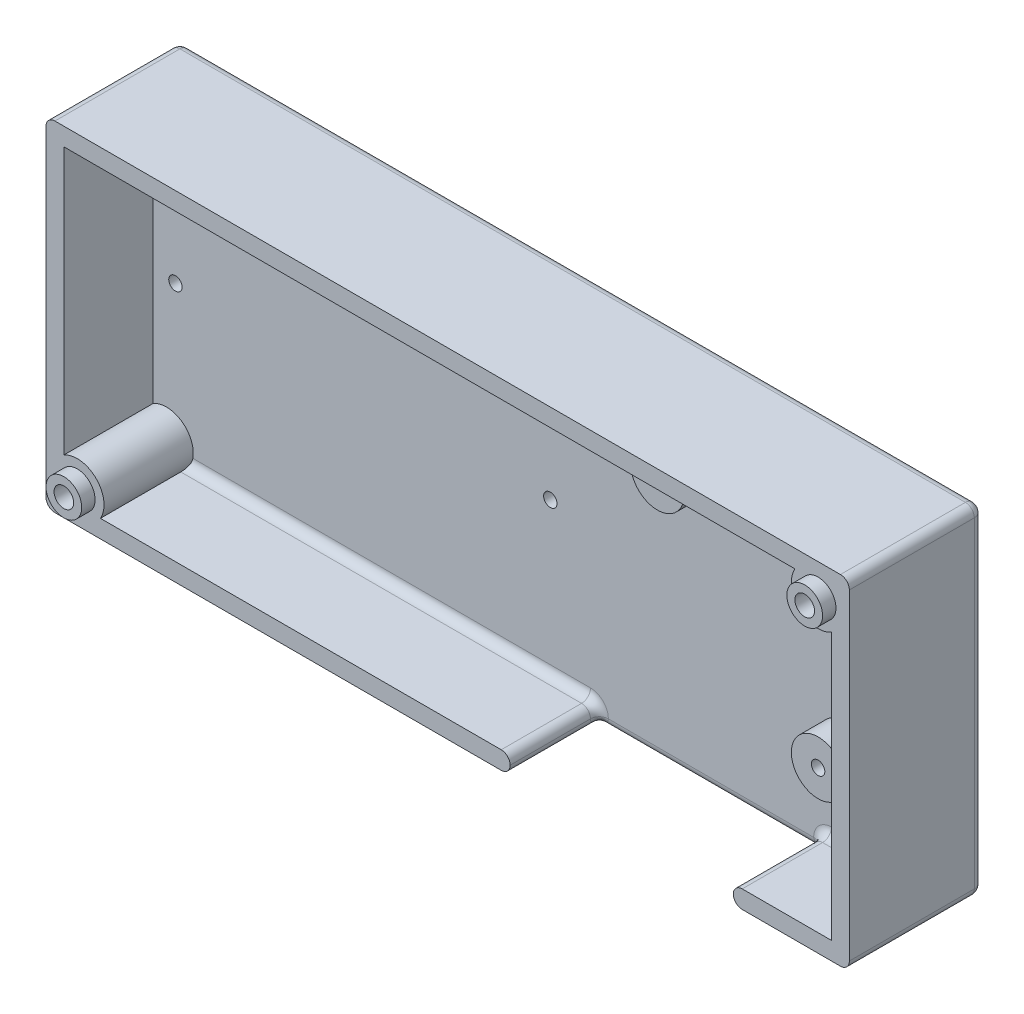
ISO-10303-21;
HEADER;
FILE_DESCRIPTION(('STEP AP214'),'2;1');
FILE_NAME('part.step','',(''),(''),'','','');
FILE_SCHEMA(('AUTOMOTIVE_DESIGN { 1 0 10303 214 1 1 1 1 }'));
ENDSEC;
DATA;
#1=APPLICATION_CONTEXT('core data for automotive mechanical design processes');
#2=APPLICATION_PROTOCOL_DEFINITION('international standard','automotive_design',2000,#1);
#3=PRODUCT_CONTEXT('',#1,'mechanical');
#4=PRODUCT('Part','Part','',(#3));
#5=PRODUCT_RELATED_PRODUCT_CATEGORY('part','',(#4));
#6=PRODUCT_DEFINITION_FORMATION('','',#4);
#7=PRODUCT_DEFINITION_CONTEXT('part definition',#1,'design');
#8=PRODUCT_DEFINITION('design','',#6,#7);
#9=PRODUCT_DEFINITION_SHAPE('','',#8);
#10=(LENGTH_UNIT() NAMED_UNIT(*) SI_UNIT(.MILLI.,.METRE.));
#11=(NAMED_UNIT(*) PLANE_ANGLE_UNIT() SI_UNIT($,.RADIAN.));
#12=(NAMED_UNIT(*) SI_UNIT($,.STERADIAN.) SOLID_ANGLE_UNIT());
#13=UNCERTAINTY_MEASURE_WITH_UNIT(LENGTH_MEASURE(1.E-05),#10,'distance_accuracy_value','');
#14=(GEOMETRIC_REPRESENTATION_CONTEXT(3) GLOBAL_UNCERTAINTY_ASSIGNED_CONTEXT((#13)) GLOBAL_UNIT_ASSIGNED_CONTEXT((#10,
#11,#12)) REPRESENTATION_CONTEXT('',''));
#15=CARTESIAN_POINT('',(0.,0.,0.));
#16=DIRECTION('',(0.,0.,1.));
#17=DIRECTION('',(1.,0.,0.));
#18=AXIS2_PLACEMENT_3D('',#15,#16,#17);
#19=CARTESIAN_POINT('',(-43.,-17.,15.));
#20=DIRECTION('',(0.,1.,0.));
#21=DIRECTION('',(-1.,0.,0.));
#22=AXIS2_PLACEMENT_3D('',#19,#20,#21);
#23=PLANE('',#22);
#24=DIRECTION('',(0.,0.,-1.));
#25=VECTOR('',#24,1.);
#26=CARTESIAN_POINT('',(6.00000000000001,-17.,5.));
#27=LINE('',#26,#25);
#28=CARTESIAN_POINT('',(6.00000000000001,-17.,15.));
#29=VERTEX_POINT('',#28);
#30=CARTESIAN_POINT('',(6.00000000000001,-17.,6.));
#31=VERTEX_POINT('',#30);
#32=EDGE_CURVE('E368',#29,#31,#27,.T.);
#33=ORIENTED_EDGE('',*,*,#32,.T.);
#34=DIRECTION('',(1.,0.,0.));
#35=VECTOR('',#34,1.);
#36=CARTESIAN_POINT('',(-38.9019237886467,-17.,6.));
#37=LINE('',#36,#35);
#38=CARTESIAN_POINT('',(-38.9019237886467,-17.,6.));
#39=VERTEX_POINT('',#38);
#40=EDGE_CURVE('E58',#31,#39,#37,.F.);
#41=ORIENTED_EDGE('',*,*,#40,.T.);
#42=DIRECTION('',(0.,0.,-1.));
#43=VECTOR('',#42,1.);
#44=CARTESIAN_POINT('',(-38.9019237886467,-17.,23.4852813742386));
#45=LINE('',#44,#43);
#46=CARTESIAN_POINT('',(-38.9019237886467,-17.,15.));
#47=VERTEX_POINT('',#46);
#48=EDGE_CURVE('E736',#39,#47,#45,.F.);
#49=ORIENTED_EDGE('',*,*,#48,.T.);
#50=DIRECTION('',(1.,0.,0.));
#51=VECTOR('',#50,1.);
#52=CARTESIAN_POINT('',(-43.,-17.,15.));
#53=LINE('',#52,#51);
#54=EDGE_CURVE('E268',#47,#29,#53,.T.);
#55=ORIENTED_EDGE('',*,*,#54,.T.);
#56=EDGE_LOOP('',(#33,#41,#49,#55));
#57=FACE_BOUND('',#56,.T.);
#58=ADVANCED_FACE('F47',(#57),#23,.T.);
#59=CARTESIAN_POINT('',(43.,-17.,15.));
#60=DIRECTION('',(-1.,0.,0.));
#61=DIRECTION('',(0.,0.,1.));
#62=AXIS2_PLACEMENT_3D('',#59,#60,#61);
#63=PLANE('',#62);
#64=DIRECTION('',(0.,0.,-1.));
#65=VECTOR('',#64,1.);
#66=CARTESIAN_POINT('',(43.,12.9019237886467,23.4852813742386));
#67=LINE('',#66,#65);
#68=CARTESIAN_POINT('',(43.,12.9019237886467,15.));
#69=VERTEX_POINT('',#68);
#70=CARTESIAN_POINT('',(43.,12.9019237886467,6.));
#71=VERTEX_POINT('',#70);
#72=EDGE_CURVE('E236',#69,#71,#67,.T.);
#73=ORIENTED_EDGE('',*,*,#72,.T.);
#74=DIRECTION('',(0.,1.,0.));
#75=VECTOR('',#74,1.);
#76=CARTESIAN_POINT('',(43.,-17.,6.));
#77=LINE('',#76,#75);
#78=CARTESIAN_POINT('',(43.,-17.,6.));
#79=VERTEX_POINT('',#78);
#80=EDGE_CURVE('E724',#71,#79,#77,.F.);
#81=ORIENTED_EDGE('',*,*,#80,.T.);
#82=DIRECTION('',(0.,0.,-1.));
#83=VECTOR('',#82,1.);
#84=CARTESIAN_POINT('',(43.,-17.,15.));
#85=LINE('',#84,#83);
#86=CARTESIAN_POINT('',(43.,-17.,15.));
#87=VERTEX_POINT('',#86);
#88=EDGE_CURVE('E272',#87,#79,#85,.T.);
#89=ORIENTED_EDGE('',*,*,#88,.F.);
#90=DIRECTION('',(0.,1.,0.));
#91=VECTOR('',#90,1.);
#92=CARTESIAN_POINT('',(43.,-17.,15.));
#93=LINE('',#92,#91);
#94=EDGE_CURVE('E258',#87,#69,#93,.T.);
#95=ORIENTED_EDGE('',*,*,#94,.T.);
#96=EDGE_LOOP('',(#73,#81,#89,#95));
#97=FACE_BOUND('',#96,.T.);
#98=ADVANCED_FACE('F628',(#97),#63,.T.);
#99=CARTESIAN_POINT('',(43.,17.,15.));
#100=DIRECTION('',(0.,-1.,0.));
#101=DIRECTION('',(1.,0.,0.));
#102=AXIS2_PLACEMENT_3D('',#99,#100,#101);
#103=PLANE('',#102);
#104=DIRECTION('',(0.,0.,-1.));
#105=VECTOR('',#104,1.);
#106=CARTESIAN_POINT('',(-43.,17.,15.));
#107=LINE('',#106,#105);
#108=CARTESIAN_POINT('',(-43.,17.,15.));
#109=VERTEX_POINT('',#108);
#110=CARTESIAN_POINT('',(-43.,17.,6.));
#111=VERTEX_POINT('',#110);
#112=EDGE_CURVE('E279',#109,#111,#107,.T.);
#113=ORIENTED_EDGE('',*,*,#112,.T.);
#114=DIRECTION('',(-1.,0.,0.));
#115=VECTOR('',#114,1.);
#116=CARTESIAN_POINT('',(38.9019237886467,17.,6.));
#117=LINE('',#116,#115);
#118=CARTESIAN_POINT('',(38.9019237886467,17.,6.));
#119=VERTEX_POINT('',#118);
#120=EDGE_CURVE('E232',#111,#119,#117,.F.);
#121=ORIENTED_EDGE('',*,*,#120,.T.);
#122=DIRECTION('',(0.,0.,-1.));
#123=VECTOR('',#122,1.);
#124=CARTESIAN_POINT('',(38.9019237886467,17.,23.4852813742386));
#125=LINE('',#124,#123);
#126=CARTESIAN_POINT('',(38.9019237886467,17.,15.));
#127=VERTEX_POINT('',#126);
#128=EDGE_CURVE('E226',#119,#127,#125,.F.);
#129=ORIENTED_EDGE('',*,*,#128,.T.);
#130=DIRECTION('',(-1.,0.,0.));
#131=VECTOR('',#130,1.);
#132=CARTESIAN_POINT('',(43.,17.,15.));
#133=LINE('',#132,#131);
#134=EDGE_CURVE('E230',#127,#109,#133,.T.);
#135=ORIENTED_EDGE('',*,*,#134,.T.);
#136=EDGE_LOOP('',(#113,#121,#129,#135));
#137=FACE_BOUND('',#136,.T.);
#138=ADVANCED_FACE('F228',(#137),#103,.T.);
#139=CARTESIAN_POINT('',(-43.,17.,15.));
#140=DIRECTION('',(1.,0.,0.));
#141=DIRECTION('',(0.,1.,0.));
#142=AXIS2_PLACEMENT_3D('',#139,#140,#141);
#143=PLANE('',#142);
#144=DIRECTION('',(0.,-1.,0.));
#145=VECTOR('',#144,1.);
#146=CARTESIAN_POINT('',(-43.,17.,5.));
#147=LINE('',#146,#145);
#148=CARTESIAN_POINT('',(-43.,16.,5.));
#149=VERTEX_POINT('',#148);
#150=CARTESIAN_POINT('',(-43.,-12.9019237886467,5.));
#151=VERTEX_POINT('',#150);
#152=EDGE_CURVE('E264',#149,#151,#147,.T.);
#153=ORIENTED_EDGE('',*,*,#152,.F.);
#154=CARTESIAN_POINT('',(-43.,16.,6.));
#155=DIRECTION('',(1.,0.,0.));
#156=DIRECTION('',(0.,1.,0.));
#157=AXIS2_PLACEMENT_3D('',#154,#155,#156);
#158=CIRCLE('',#157,1.);
#159=EDGE_CURVE('E73',#149,#111,#158,.T.);
#160=ORIENTED_EDGE('',*,*,#159,.T.);
#161=ORIENTED_EDGE('',*,*,#112,.F.);
#162=DIRECTION('',(0.,-1.,0.));
#163=VECTOR('',#162,1.);
#164=CARTESIAN_POINT('',(-43.,17.,15.));
#165=LINE('',#164,#163);
#166=CARTESIAN_POINT('',(-43.,-12.9019237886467,15.));
#167=VERTEX_POINT('',#166);
#168=EDGE_CURVE('E256',#109,#167,#165,.T.);
#169=ORIENTED_EDGE('',*,*,#168,.T.);
#170=DIRECTION('',(0.,0.,-1.));
#171=VECTOR('',#170,1.);
#172=CARTESIAN_POINT('',(-43.,-12.9019237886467,23.4852813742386));
#173=LINE('',#172,#171);
#174=EDGE_CURVE('E739',#167,#151,#173,.T.);
#175=ORIENTED_EDGE('',*,*,#174,.T.);
#176=EDGE_LOOP('',(#153,#160,#161,#169,#175));
#177=FACE_BOUND('',#176,.T.);
#178=ADVANCED_FACE('F634',(#177),#143,.T.);
#179=ORIENTED_EDGE('',*,*,#88,.T.);
#180=DIRECTION('',(1.,0.,0.));
#181=VECTOR('',#180,1.);
#182=CARTESIAN_POINT('',(33.,-17.,6.));
#183=LINE('',#182,#181);
#184=CARTESIAN_POINT('',(33.,-17.,6.));
#185=VERTEX_POINT('',#184);
#186=EDGE_CURVE('E720',#79,#185,#183,.F.);
#187=ORIENTED_EDGE('',*,*,#186,.T.);
#188=DIRECTION('',(0.,0.,1.));
#189=VECTOR('',#188,1.);
#190=CARTESIAN_POINT('',(33.,-17.,15.));
#191=LINE('',#190,#189);
#192=CARTESIAN_POINT('',(33.,-17.,15.));
#193=VERTEX_POINT('',#192);
#194=EDGE_CURVE('E303',#185,#193,#191,.T.);
#195=ORIENTED_EDGE('',*,*,#194,.T.);
#196=EDGE_CURVE('E262',#193,#87,#53,.T.);
#197=ORIENTED_EDGE('',*,*,#196,.T.);
#198=EDGE_LOOP('',(#179,#187,#195,#197));
#199=FACE_BOUND('',#198,.T.);
#200=ADVANCED_FACE('F604',(#199),#23,.T.);
#201=CARTESIAN_POINT('',(-45.,-19.,5.));
#202=DIRECTION('',(1.,0.,0.));
#203=DIRECTION('',(0.,0.,-1.));
#204=AXIS2_PLACEMENT_3D('',#201,#202,#203);
#205=PLANE('',#204);
#206=DIRECTION('',(0.,-1.,0.));
#207=VECTOR('',#206,1.);
#208=CARTESIAN_POINT('',(-45.,19.,15.));
#209=LINE('',#208,#207);
#210=CARTESIAN_POINT('',(-45.,18.,15.));
#211=VERTEX_POINT('',#210);
#212=CARTESIAN_POINT('',(-45.,-18.,15.));
#213=VERTEX_POINT('',#212);
#214=EDGE_CURVE('E286',#211,#213,#209,.T.);
#215=ORIENTED_EDGE('',*,*,#214,.F.);
#216=DIRECTION('',(0.,0.,-1.));
#217=VECTOR('',#216,1.);
#218=CARTESIAN_POINT('',(-45.,18.,5.));
#219=LINE('',#218,#217);
#220=CARTESIAN_POINT('',(-45.,18.,1.));
#221=VERTEX_POINT('',#220);
#222=EDGE_CURVE('E409',#211,#221,#219,.T.);
#223=ORIENTED_EDGE('',*,*,#222,.T.);
#224=DIRECTION('',(0.,-1.,0.));
#225=VECTOR('',#224,1.);
#226=CARTESIAN_POINT('',(-45.,-19.,1.));
#227=LINE('',#226,#225);
#228=CARTESIAN_POINT('',(-45.,-18.,1.));
#229=VERTEX_POINT('',#228);
#230=EDGE_CURVE('E406',#221,#229,#227,.T.);
#231=ORIENTED_EDGE('',*,*,#230,.T.);
#232=DIRECTION('',(0.,0.,-1.));
#233=VECTOR('',#232,1.);
#234=CARTESIAN_POINT('',(-45.,-18.,5.));
#235=LINE('',#234,#233);
#236=EDGE_CURVE('E403',#229,#213,#235,.F.);
#237=ORIENTED_EDGE('',*,*,#236,.T.);
#238=EDGE_LOOP('',(#215,#223,#231,#237));
#239=FACE_BOUND('',#238,.T.);
#240=ADVANCED_FACE('F600',(#239),#205,.F.);
#241=CARTESIAN_POINT('',(45.,-19.,5.));
#242=DIRECTION('',(0.,1.,0.));
#243=DIRECTION('',(-1.,0.,0.));
#244=AXIS2_PLACEMENT_3D('',#241,#242,#243);
#245=PLANE('',#244);
#246=DIRECTION('',(1.,0.,0.));
#247=VECTOR('',#246,1.);
#248=CARTESIAN_POINT('',(-45.,-19.,15.));
#249=LINE('',#248,#247);
#250=CARTESIAN_POINT('',(33.,-19.,15.));
#251=VERTEX_POINT('',#250);
#252=CARTESIAN_POINT('',(44.,-19.,15.));
#253=VERTEX_POINT('',#252);
#254=EDGE_CURVE('E290',#251,#253,#249,.T.);
#255=ORIENTED_EDGE('',*,*,#254,.F.);
#256=DIRECTION('',(0.,0.,1.));
#257=VECTOR('',#256,1.);
#258=CARTESIAN_POINT('',(33.,-19.,5.));
#259=LINE('',#258,#257);
#260=CARTESIAN_POINT('',(33.,-19.,4.));
#261=VERTEX_POINT('',#260);
#262=EDGE_CURVE('E360',#251,#261,#259,.F.);
#263=ORIENTED_EDGE('',*,*,#262,.T.);
#264=DIRECTION('',(1.,0.,0.));
#265=VECTOR('',#264,1.);
#266=CARTESIAN_POINT('',(7.,-19.,4.));
#267=LINE('',#266,#265);
#268=CARTESIAN_POINT('',(6.,-19.,4.));
#269=VERTEX_POINT('',#268);
#270=EDGE_CURVE('E356',#261,#269,#267,.F.);
#271=ORIENTED_EDGE('',*,*,#270,.T.);
#272=DIRECTION('',(0.,0.,-1.));
#273=VECTOR('',#272,1.);
#274=CARTESIAN_POINT('',(6.,-19.,4.99999999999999));
#275=LINE('',#274,#273);
#276=CARTESIAN_POINT('',(5.99999999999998,-19.,15.));
#277=VERTEX_POINT('',#276);
#278=EDGE_CURVE('E353',#269,#277,#275,.F.);
#279=ORIENTED_EDGE('',*,*,#278,.T.);
#280=CARTESIAN_POINT('',(-44.,-19.,15.));
#281=VERTEX_POINT('',#280);
#282=EDGE_CURVE('E291',#281,#277,#249,.T.);
#283=ORIENTED_EDGE('',*,*,#282,.F.);
#284=DIRECTION('',(0.,0.,-1.));
#285=VECTOR('',#284,1.);
#286=CARTESIAN_POINT('',(-44.,-19.,5.));
#287=LINE('',#286,#285);
#288=CARTESIAN_POINT('',(-44.,-19.,1.));
#289=VERTEX_POINT('',#288);
#290=EDGE_CURVE('E347',#281,#289,#287,.T.);
#291=ORIENTED_EDGE('',*,*,#290,.T.);
#292=DIRECTION('',(1.,0.,0.));
#293=VECTOR('',#292,1.);
#294=CARTESIAN_POINT('',(45.,-19.,1.));
#295=LINE('',#294,#293);
#296=CARTESIAN_POINT('',(44.,-19.,1.));
#297=VERTEX_POINT('',#296);
#298=EDGE_CURVE('E344',#289,#297,#295,.T.);
#299=ORIENTED_EDGE('',*,*,#298,.T.);
#300=DIRECTION('',(0.,0.,-1.));
#301=VECTOR('',#300,1.);
#302=CARTESIAN_POINT('',(44.,-19.,5.));
#303=LINE('',#302,#301);
#304=EDGE_CURVE('E350',#297,#253,#303,.F.);
#305=ORIENTED_EDGE('',*,*,#304,.T.);
#306=EDGE_LOOP('',(#255,#263,#271,#279,#283,#291,#299,#305));
#307=FACE_BOUND('',#306,.T.);
#308=ADVANCED_FACE('F603',(#307),#245,.F.);
#309=CARTESIAN_POINT('',(45.,-19.,5.));
#310=DIRECTION('',(-1.,0.,0.));
#311=DIRECTION('',(0.,0.,1.));
#312=AXIS2_PLACEMENT_3D('',#309,#310,#311);
#313=PLANE('',#312);
#314=DIRECTION('',(0.,1.,0.));
#315=VECTOR('',#314,1.);
#316=CARTESIAN_POINT('',(45.,-19.,15.));
#317=LINE('',#316,#315);
#318=CARTESIAN_POINT('',(45.,-18.,15.));
#319=VERTEX_POINT('',#318);
#320=CARTESIAN_POINT('',(45.,18.,15.));
#321=VERTEX_POINT('',#320);
#322=EDGE_CURVE('E295',#319,#321,#317,.T.);
#323=ORIENTED_EDGE('',*,*,#322,.F.);
#324=DIRECTION('',(0.,0.,-1.));
#325=VECTOR('',#324,1.);
#326=CARTESIAN_POINT('',(45.,-18.,5.));
#327=LINE('',#326,#325);
#328=CARTESIAN_POINT('',(45.,-18.,1.));
#329=VERTEX_POINT('',#328);
#330=EDGE_CURVE('E377',#319,#329,#327,.T.);
#331=ORIENTED_EDGE('',*,*,#330,.T.);
#332=DIRECTION('',(0.,1.,0.));
#333=VECTOR('',#332,1.);
#334=CARTESIAN_POINT('',(45.,-19.,1.));
#335=LINE('',#334,#333);
#336=CARTESIAN_POINT('',(45.,18.,1.));
#337=VERTEX_POINT('',#336);
#338=EDGE_CURVE('E374',#329,#337,#335,.T.);
#339=ORIENTED_EDGE('',*,*,#338,.T.);
#340=DIRECTION('',(0.,0.,-1.));
#341=VECTOR('',#340,1.);
#342=CARTESIAN_POINT('',(45.,18.,5.));
#343=LINE('',#342,#341);
#344=EDGE_CURVE('E371',#337,#321,#343,.F.);
#345=ORIENTED_EDGE('',*,*,#344,.T.);
#346=EDGE_LOOP('',(#323,#331,#339,#345));
#347=FACE_BOUND('',#346,.T.);
#348=ADVANCED_FACE('F608',(#347),#313,.F.);
#349=CARTESIAN_POINT('',(45.,19.,5.));
#350=DIRECTION('',(0.,-1.,0.));
#351=DIRECTION('',(1.,0.,0.));
#352=AXIS2_PLACEMENT_3D('',#349,#350,#351);
#353=PLANE('',#352);
#354=DIRECTION('',(-1.,0.,0.));
#355=VECTOR('',#354,1.);
#356=CARTESIAN_POINT('',(45.,19.,15.));
#357=LINE('',#356,#355);
#358=CARTESIAN_POINT('',(44.,19.,15.));
#359=VERTEX_POINT('',#358);
#360=CARTESIAN_POINT('',(-44.,19.,15.));
#361=VERTEX_POINT('',#360);
#362=EDGE_CURVE('E282',#359,#361,#357,.T.);
#363=ORIENTED_EDGE('',*,*,#362,.F.);
#364=DIRECTION('',(0.,0.,-1.));
#365=VECTOR('',#364,1.);
#366=CARTESIAN_POINT('',(44.,19.,5.));
#367=LINE('',#366,#365);
#368=CARTESIAN_POINT('',(44.,19.,1.));
#369=VERTEX_POINT('',#368);
#370=EDGE_CURVE('E400',#359,#369,#367,.T.);
#371=ORIENTED_EDGE('',*,*,#370,.T.);
#372=DIRECTION('',(-1.,0.,0.));
#373=VECTOR('',#372,1.);
#374=CARTESIAN_POINT('',(45.,19.,1.));
#375=LINE('',#374,#373);
#376=CARTESIAN_POINT('',(-44.,19.,1.));
#377=VERTEX_POINT('',#376);
#378=EDGE_CURVE('E397',#369,#377,#375,.T.);
#379=ORIENTED_EDGE('',*,*,#378,.T.);
#380=DIRECTION('',(0.,0.,-1.));
#381=VECTOR('',#380,1.);
#382=CARTESIAN_POINT('',(-44.,19.,5.));
#383=LINE('',#382,#381);
#384=EDGE_CURVE('E394',#377,#361,#383,.F.);
#385=ORIENTED_EDGE('',*,*,#384,.T.);
#386=EDGE_LOOP('',(#363,#371,#379,#385));
#387=FACE_BOUND('',#386,.T.);
#388=ADVANCED_FACE('F612',(#387),#353,.F.);
#389=CARTESIAN_POINT('',(0.,0.,0.));
#390=DIRECTION('',(0.,0.,1.));
#391=DIRECTION('',(1.,0.,0.));
#392=AXIS2_PLACEMENT_3D('',#389,#390,#391);
#393=PLANE('',#392);
#394=DIRECTION('',(-1.,0.,0.));
#395=VECTOR('',#394,1.);
#396=CARTESIAN_POINT('',(0.,18.,0.));
#397=LINE('',#396,#395);
#398=CARTESIAN_POINT('',(-44.,18.,0.));
#399=VERTEX_POINT('',#398);
#400=CARTESIAN_POINT('',(44.,18.,0.));
#401=VERTEX_POINT('',#400);
#402=EDGE_CURVE('E387',#399,#401,#397,.F.);
#403=ORIENTED_EDGE('',*,*,#402,.T.);
#404=DIRECTION('',(0.,1.,0.));
#405=VECTOR('',#404,1.);
#406=CARTESIAN_POINT('',(44.,0.,0.));
#407=LINE('',#406,#405);
#408=CARTESIAN_POINT('',(44.,-18.,0.));
#409=VERTEX_POINT('',#408);
#410=EDGE_CURVE('E390',#401,#409,#407,.F.);
#411=ORIENTED_EDGE('',*,*,#410,.T.);
#412=DIRECTION('',(1.,0.,0.));
#413=VECTOR('',#412,1.);
#414=CARTESIAN_POINT('',(0.,-18.,0.));
#415=LINE('',#414,#413);
#416=CARTESIAN_POINT('',(-44.,-18.,0.));
#417=VERTEX_POINT('',#416);
#418=EDGE_CURVE('E381',#409,#417,#415,.F.);
#419=ORIENTED_EDGE('',*,*,#418,.T.);
#420=DIRECTION('',(0.,-1.,0.));
#421=VECTOR('',#420,1.);
#422=CARTESIAN_POINT('',(-44.,0.,0.));
#423=LINE('',#422,#421);
#424=EDGE_CURVE('E384',#417,#399,#423,.F.);
#425=ORIENTED_EDGE('',*,*,#424,.T.);
#426=EDGE_LOOP('',(#403,#411,#419,#425));
#427=FACE_BOUND('',#426,.T.);
#428=CARTESIAN_POINT('',(41.5,15.5,0.));
#429=DIRECTION('',(0.,0.,1.));
#430=DIRECTION('',(1.,0.,0.));
#431=AXIS2_PLACEMENT_3D('',#428,#429,#430);
#432=CIRCLE('',#431,1.1);
#433=CARTESIAN_POINT('',(42.6,15.5,0.));
#434=VERTEX_POINT('',#433);
#435=EDGE_CURVE('E310',#434,#434,#432,.T.);
#436=ORIENTED_EDGE('',*,*,#435,.T.);
#437=EDGE_LOOP('',(#436));
#438=FACE_BOUND('',#437,.T.);
#439=CARTESIAN_POINT('',(-41.5,-15.5,0.));
#440=DIRECTION('',(0.,0.,1.));
#441=DIRECTION('',(1.,0.,0.));
#442=AXIS2_PLACEMENT_3D('',#439,#440,#441);
#443=CIRCLE('',#442,1.1);
#444=CARTESIAN_POINT('',(-40.4,-15.5,0.));
#445=VERTEX_POINT('',#444);
#446=EDGE_CURVE('E304',#445,#445,#443,.T.);
#447=ORIENTED_EDGE('',*,*,#446,.T.);
#448=EDGE_LOOP('',(#447));
#449=FACE_BOUND('',#448,.T.);
#450=ADVANCED_FACE('F616',(#427,#438,#449),#393,.F.);
#451=CARTESIAN_POINT('',(0.,0.,15.));
#452=DIRECTION('',(0.,0.,1.));
#453=DIRECTION('',(1.,0.,0.));
#454=AXIS2_PLACEMENT_3D('',#451,#452,#453);
#455=PLANE('',#454);
#456=ORIENTED_EDGE('',*,*,#196,.F.);
#457=CARTESIAN_POINT('',(33.,-18.,15.));
#458=DIRECTION('',(0.,0.,1.));
#459=DIRECTION('',(1.,0.,0.));
#460=AXIS2_PLACEMENT_3D('',#457,#458,#459);
#461=CIRCLE('',#460,1.);
#462=CARTESIAN_POINT('',(32.,-18.,15.));
#463=VERTEX_POINT('',#462);
#464=EDGE_CURVE('E340',#193,#463,#461,.T.);
#465=ORIENTED_EDGE('',*,*,#464,.T.);
#466=CARTESIAN_POINT('',(33.,-18.,15.));
#467=DIRECTION('',(0.,0.,1.));
#468=DIRECTION('',(1.,0.,0.));
#469=AXIS2_PLACEMENT_3D('',#466,#467,#468);
#470=CIRCLE('',#469,1.);
#471=EDGE_CURVE('E337',#463,#251,#470,.T.);
#472=ORIENTED_EDGE('',*,*,#471,.T.);
#473=ORIENTED_EDGE('',*,*,#254,.T.);
#474=CARTESIAN_POINT('',(44.,-18.,15.));
#475=DIRECTION('',(0.,0.,1.));
#476=DIRECTION('',(1.,0.,0.));
#477=AXIS2_PLACEMENT_3D('',#474,#475,#476);
#478=CIRCLE('',#477,1.);
#479=EDGE_CURVE('E327',#253,#319,#478,.T.);
#480=ORIENTED_EDGE('',*,*,#479,.T.);
#481=ORIENTED_EDGE('',*,*,#322,.T.);
#482=CARTESIAN_POINT('',(44.,18.,15.));
#483=DIRECTION('',(0.,0.,1.));
#484=DIRECTION('',(1.,0.,0.));
#485=AXIS2_PLACEMENT_3D('',#482,#483,#484);
#486=CIRCLE('',#485,1.);
#487=EDGE_CURVE('E324',#321,#359,#486,.T.);
#488=ORIENTED_EDGE('',*,*,#487,.T.);
#489=ORIENTED_EDGE('',*,*,#362,.T.);
#490=CARTESIAN_POINT('',(-44.,18.,15.));
#491=DIRECTION('',(0.,0.,1.));
#492=DIRECTION('',(1.,0.,0.));
#493=AXIS2_PLACEMENT_3D('',#490,#491,#492);
#494=CIRCLE('',#493,1.);
#495=EDGE_CURVE('E321',#361,#211,#494,.T.);
#496=ORIENTED_EDGE('',*,*,#495,.T.);
#497=ORIENTED_EDGE('',*,*,#214,.T.);
#498=CARTESIAN_POINT('',(-44.,-18.,15.));
#499=DIRECTION('',(0.,0.,1.));
#500=DIRECTION('',(1.,0.,0.));
#501=AXIS2_PLACEMENT_3D('',#498,#499,#500);
#502=CIRCLE('',#501,1.);
#503=EDGE_CURVE('E318',#213,#281,#502,.T.);
#504=ORIENTED_EDGE('',*,*,#503,.T.);
#505=ORIENTED_EDGE('',*,*,#282,.T.);
#506=CARTESIAN_POINT('',(6.,-18.,15.));
#507=DIRECTION('',(0.,0.,1.));
#508=DIRECTION('',(1.,0.,0.));
#509=AXIS2_PLACEMENT_3D('',#506,#507,#508);
#510=CIRCLE('',#509,1.);
#511=CARTESIAN_POINT('',(7.,-18.,15.));
#512=VERTEX_POINT('',#511);
#513=EDGE_CURVE('E330',#277,#512,#510,.T.);
#514=ORIENTED_EDGE('',*,*,#513,.T.);
#515=CARTESIAN_POINT('',(6.00000000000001,-18.,15.));
#516=DIRECTION('',(0.,0.,1.));
#517=DIRECTION('',(1.,0.,0.));
#518=AXIS2_PLACEMENT_3D('',#515,#516,#517);
#519=CIRCLE('',#518,1.);
#520=EDGE_CURVE('E334',#512,#29,#519,.T.);
#521=ORIENTED_EDGE('',*,*,#520,.T.);
#522=ORIENTED_EDGE('',*,*,#54,.F.);
#523=CARTESIAN_POINT('',(-41.5,-15.5,15.));
#524=DIRECTION('',(0.,0.,1.));
#525=DIRECTION('',(1.,0.,0.));
#526=AXIS2_PLACEMENT_3D('',#523,#524,#525);
#527=CIRCLE('',#526,3.);
#528=EDGE_CURVE('E733',#47,#167,#527,.T.);
#529=ORIENTED_EDGE('',*,*,#528,.T.);
#530=ORIENTED_EDGE('',*,*,#168,.F.);
#531=ORIENTED_EDGE('',*,*,#134,.F.);
#532=CARTESIAN_POINT('',(41.5,15.5,15.));
#533=DIRECTION('',(0.,0.,1.));
#534=DIRECTION('',(1.,0.,0.));
#535=AXIS2_PLACEMENT_3D('',#532,#533,#534);
#536=CIRCLE('',#535,3.);
#537=EDGE_CURVE('E240',#127,#69,#536,.T.);
#538=ORIENTED_EDGE('',*,*,#537,.T.);
#539=ORIENTED_EDGE('',*,*,#94,.F.);
#540=EDGE_LOOP('',(#456,#465,#472,#473,#480,#481,#488,#489,#496,#497,#504,#505,#514,#521,#522,
#529,#530,#531,#538,#539));
#541=FACE_BOUND('',#540,.T.);
#542=CARTESIAN_POINT('',(41.5,15.5,15.));
#543=DIRECTION('',(0.,0.,1.));
#544=DIRECTION('',(1.,0.,0.));
#545=AXIS2_PLACEMENT_3D('',#542,#543,#544);
#546=CIRCLE('',#545,2.);
#547=CARTESIAN_POINT('',(43.5,15.5,15.));
#548=VERTEX_POINT('',#547);
#549=EDGE_CURVE('E1329',#548,#548,#546,.T.);
#550=ORIENTED_EDGE('',*,*,#549,.F.);
#551=EDGE_LOOP('',(#550));
#552=FACE_BOUND('',#551,.T.);
#553=CARTESIAN_POINT('',(-41.5,-15.5,15.));
#554=DIRECTION('',(0.,0.,1.));
#555=DIRECTION('',(1.,0.,0.));
#556=AXIS2_PLACEMENT_3D('',#553,#554,#555);
#557=CIRCLE('',#556,2.);
#558=CARTESIAN_POINT('',(-39.5,-15.5,15.));
#559=VERTEX_POINT('',#558);
#560=EDGE_CURVE('E1323',#559,#559,#557,.T.);
#561=ORIENTED_EDGE('',*,*,#560,.F.);
#562=EDGE_LOOP('',(#561));
#563=FACE_BOUND('',#562,.T.);
#564=ADVANCED_FACE('F252',(#541,#552,#563),#455,.T.);
#565=CARTESIAN_POINT('',(0.,0.,5.));
#566=DIRECTION('',(0.,0.,1.));
#567=DIRECTION('',(1.,0.,0.));
#568=AXIS2_PLACEMENT_3D('',#565,#566,#567);
#569=PLANE('',#568);
#570=DIRECTION('',(1.,0.,0.));
#571=VECTOR('',#570,1.);
#572=CARTESIAN_POINT('',(32.,-18.,5.));
#573=LINE('',#572,#571);
#574=CARTESIAN_POINT('',(8.00000000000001,-18.,5.));
#575=VERTEX_POINT('',#574);
#576=CARTESIAN_POINT('',(31.,-18.,5.));
#577=VERTEX_POINT('',#576);
#578=EDGE_CURVE('E364',#575,#577,#573,.T.);
#579=ORIENTED_EDGE('',*,*,#578,.T.);
#580=CARTESIAN_POINT('',(33.,-18.,5.));
#581=DIRECTION('',(0.,0.,1.));
#582=DIRECTION('',(1.,0.,0.));
#583=AXIS2_PLACEMENT_3D('',#580,#581,#582);
#584=CIRCLE('',#583,2.);
#585=CARTESIAN_POINT('',(33.,-16.,5.));
#586=VERTEX_POINT('',#585);
#587=EDGE_CURVE('E491',#577,#586,#584,.F.);
#588=ORIENTED_EDGE('',*,*,#587,.T.);
#589=DIRECTION('',(1.,0.,0.));
#590=VECTOR('',#589,1.);
#591=CARTESIAN_POINT('',(43.,-16.,5.));
#592=LINE('',#591,#590);
#593=CARTESIAN_POINT('',(42.,-16.,5.));
#594=VERTEX_POINT('',#593);
#595=EDGE_CURVE('E485',#586,#594,#592,.T.);
#596=ORIENTED_EDGE('',*,*,#595,.T.);
#597=DIRECTION('',(0.,1.,0.));
#598=VECTOR('',#597,1.);
#599=CARTESIAN_POINT('',(42.,12.9019237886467,5.));
#600=LINE('',#599,#598);
#601=CARTESIAN_POINT('',(42.,12.5419601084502,5.));
#602=VERTEX_POINT('',#601);
#603=EDGE_CURVE('E488',#594,#602,#600,.T.);
#604=ORIENTED_EDGE('',*,*,#603,.T.);
#605=CARTESIAN_POINT('',(41.5,15.5,5.));
#606=DIRECTION('',(0.,0.,1.));
#607=DIRECTION('',(1.,0.,0.));
#608=AXIS2_PLACEMENT_3D('',#605,#606,#607);
#609=CIRCLE('',#608,3.);
#610=CARTESIAN_POINT('',(38.5419601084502,16.,5.));
#611=VERTEX_POINT('',#610);
#612=EDGE_CURVE('E237',#611,#602,#609,.T.);
#613=ORIENTED_EDGE('',*,*,#612,.F.);
#614=DIRECTION('',(-1.,0.,0.));
#615=VECTOR('',#614,1.);
#616=CARTESIAN_POINT('',(-43.,16.,5.));
#617=LINE('',#616,#615);
#618=EDGE_CURVE('E481',#611,#149,#617,.T.);
#619=ORIENTED_EDGE('',*,*,#618,.T.);
#620=ORIENTED_EDGE('',*,*,#152,.T.);
#621=CARTESIAN_POINT('',(-41.5,-15.5,5.));
#622=DIRECTION('',(0.,0.,1.));
#623=DIRECTION('',(1.,0.,0.));
#624=AXIS2_PLACEMENT_3D('',#621,#622,#623);
#625=CIRCLE('',#624,3.);
#626=CARTESIAN_POINT('',(-38.5419601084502,-16.,5.));
#627=VERTEX_POINT('',#626);
#628=EDGE_CURVE('E299',#151,#627,#625,.F.);
#629=ORIENTED_EDGE('',*,*,#628,.T.);
#630=DIRECTION('',(1.,0.,0.));
#631=VECTOR('',#630,1.);
#632=CARTESIAN_POINT('',(6.00000000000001,-16.,5.));
#633=LINE('',#632,#631);
#634=CARTESIAN_POINT('',(6.00000000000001,-16.,5.));
#635=VERTEX_POINT('',#634);
#636=EDGE_CURVE('E475',#627,#635,#633,.T.);
#637=ORIENTED_EDGE('',*,*,#636,.T.);
#638=CARTESIAN_POINT('',(6.00000000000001,-18.,5.));
#639=DIRECTION('',(0.,0.,1.));
#640=DIRECTION('',(1.,0.,0.));
#641=AXIS2_PLACEMENT_3D('',#638,#639,#640);
#642=CIRCLE('',#641,2.);
#643=EDGE_CURVE('E478',#635,#575,#642,.F.);
#644=ORIENTED_EDGE('',*,*,#643,.T.);
#645=EDGE_LOOP('',(#579,#588,#596,#604,#613,#619,#620,#629,#637,#644));
#646=FACE_BOUND('',#645,.T.);
#647=CARTESIAN_POINT('',(1.5,0.,5.));
#648=DIRECTION('',(0.,0.,1.));
#649=DIRECTION('',(1.,0.,0.));
#650=AXIS2_PLACEMENT_3D('',#647,#648,#649);
#651=CIRCLE('',#650,0.750000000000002);
#652=CARTESIAN_POINT('',(2.25,0.,5.));
#653=VERTEX_POINT('',#652);
#654=EDGE_CURVE('E749',#653,#653,#651,.T.);
#655=ORIENTED_EDGE('',*,*,#654,.F.);
#656=EDGE_LOOP('',(#655));
#657=FACE_BOUND('',#656,.T.);
#658=CARTESIAN_POINT('',(-40.5,0.,5.));
#659=DIRECTION('',(0.,0.,1.));
#660=DIRECTION('',(1.,0.,0.));
#661=AXIS2_PLACEMENT_3D('',#658,#659,#660);
#662=CIRCLE('',#661,0.749999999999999);
#663=CARTESIAN_POINT('',(-39.75,0.,5.));
#664=VERTEX_POINT('',#663);
#665=EDGE_CURVE('E753',#664,#664,#662,.T.);
#666=ORIENTED_EDGE('',*,*,#665,.F.);
#667=EDGE_LOOP('',(#666));
#668=FACE_BOUND('',#667,.T.);
#669=CARTESIAN_POINT('',(34.5,-7.99999999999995,5.));
#670=DIRECTION('',(0.,0.,1.));
#671=DIRECTION('',(1.,0.,0.));
#672=AXIS2_PLACEMENT_3D('',#669,#670,#671);
#673=CIRCLE('',#672,3.);
#674=CARTESIAN_POINT('',(37.5,-7.99999999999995,5.));
#675=VERTEX_POINT('',#674);
#676=EDGE_CURVE('E776',#675,#675,#673,.T.);
#677=ORIENTED_EDGE('',*,*,#676,.F.);
#678=EDGE_LOOP('',(#677));
#679=FACE_BOUND('',#678,.T.);
#680=CARTESIAN_POINT('',(16.5,11.,5.));
#681=DIRECTION('',(0.,0.,1.));
#682=DIRECTION('',(1.,0.,0.));
#683=AXIS2_PLACEMENT_3D('',#680,#681,#682);
#684=CIRCLE('',#683,3.);
#685=CARTESIAN_POINT('',(19.5,11.,5.));
#686=VERTEX_POINT('',#685);
#687=EDGE_CURVE('E780',#686,#686,#684,.T.);
#688=ORIENTED_EDGE('',*,*,#687,.F.);
#689=EDGE_LOOP('',(#688));
#690=FACE_BOUND('',#689,.T.);
#691=ADVANCED_FACE('F621',(#646,#657,#668,#679,#690),#569,.T.);
#692=CARTESIAN_POINT('',(16.5,11.,8.));
#693=DIRECTION('',(0.,0.,-1.));
#694=DIRECTION('',(-1.,0.,0.));
#695=AXIS2_PLACEMENT_3D('',#692,#693,#694);
#696=CYLINDRICAL_SURFACE('',#695,3.);
#697=CARTESIAN_POINT('',(16.5,11.,8.));
#698=DIRECTION('',(0.,0.,1.));
#699=DIRECTION('',(1.,0.,0.));
#700=AXIS2_PLACEMENT_3D('',#697,#698,#699);
#701=CIRCLE('',#700,3.);
#702=CARTESIAN_POINT('',(19.5,11.,8.));
#703=VERTEX_POINT('',#702);
#704=EDGE_CURVE('E275',#703,#703,#701,.T.);
#705=ORIENTED_EDGE('',*,*,#704,.F.);
#706=EDGE_LOOP('',(#705));
#707=FACE_BOUND('',#706,.T.);
#708=ORIENTED_EDGE('',*,*,#687,.T.);
#709=EDGE_LOOP('',(#708));
#710=FACE_BOUND('',#709,.T.);
#711=ADVANCED_FACE('F624',(#707,#710),#696,.T.);
#712=CARTESIAN_POINT('',(16.5,11.,8.));
#713=DIRECTION('',(0.,0.,1.));
#714=DIRECTION('',(1.,0.,0.));
#715=AXIS2_PLACEMENT_3D('',#712,#713,#714);
#716=PLANE('',#715);
#717=CARTESIAN_POINT('',(16.5,11.,8.));
#718=DIRECTION('',(0.,0.,1.));
#719=DIRECTION('',(1.,0.,0.));
#720=AXIS2_PLACEMENT_3D('',#717,#718,#719);
#721=CIRCLE('',#720,0.750000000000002);
#722=CARTESIAN_POINT('',(17.25,11.,8.));
#723=VERTEX_POINT('',#722);
#724=EDGE_CURVE('E765',#723,#723,#721,.T.);
#725=ORIENTED_EDGE('',*,*,#724,.F.);
#726=EDGE_LOOP('',(#725));
#727=FACE_BOUND('',#726,.T.);
#728=ORIENTED_EDGE('',*,*,#704,.T.);
#729=EDGE_LOOP('',(#728));
#730=FACE_BOUND('',#729,.T.);
#731=ADVANCED_FACE('F642',(#727,#730),#716,.T.);
#732=CARTESIAN_POINT('',(34.5,-7.99999999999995,8.));
#733=DIRECTION('',(0.,0.,-1.));
#734=DIRECTION('',(-1.,0.,0.));
#735=AXIS2_PLACEMENT_3D('',#732,#733,#734);
#736=CYLINDRICAL_SURFACE('',#735,3.);
#737=CARTESIAN_POINT('',(34.5,-7.99999999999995,8.));
#738=DIRECTION('',(0.,0.,1.));
#739=DIRECTION('',(1.,0.,0.));
#740=AXIS2_PLACEMENT_3D('',#737,#738,#739);
#741=CIRCLE('',#740,3.);
#742=CARTESIAN_POINT('',(37.5,-7.99999999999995,8.));
#743=VERTEX_POINT('',#742);
#744=EDGE_CURVE('E764',#743,#743,#741,.T.);
#745=ORIENTED_EDGE('',*,*,#744,.F.);
#746=EDGE_LOOP('',(#745));
#747=FACE_BOUND('',#746,.T.);
#748=ORIENTED_EDGE('',*,*,#676,.T.);
#749=EDGE_LOOP('',(#748));
#750=FACE_BOUND('',#749,.T.);
#751=ADVANCED_FACE('F646',(#747,#750),#736,.T.);
#752=CARTESIAN_POINT('',(34.5,-7.99999999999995,8.));
#753=DIRECTION('',(0.,0.,1.));
#754=DIRECTION('',(1.,0.,0.));
#755=AXIS2_PLACEMENT_3D('',#752,#753,#754);
#756=PLANE('',#755);
#757=CARTESIAN_POINT('',(34.5,-7.99999999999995,8.));
#758=DIRECTION('',(0.,0.,1.));
#759=DIRECTION('',(1.,0.,0.));
#760=AXIS2_PLACEMENT_3D('',#757,#758,#759);
#761=CIRCLE('',#760,0.749999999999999);
#762=CARTESIAN_POINT('',(35.25,-7.99999999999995,8.));
#763=VERTEX_POINT('',#762);
#764=EDGE_CURVE('E769',#763,#763,#761,.T.);
#765=ORIENTED_EDGE('',*,*,#764,.F.);
#766=EDGE_LOOP('',(#765));
#767=FACE_BOUND('',#766,.T.);
#768=ORIENTED_EDGE('',*,*,#744,.T.);
#769=EDGE_LOOP('',(#768));
#770=FACE_BOUND('',#769,.T.);
#771=ADVANCED_FACE('F648',(#767,#770),#756,.T.);
#772=CARTESIAN_POINT('',(34.5,-7.99999999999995,5.));
#773=DIRECTION('',(0.,0.,1.));
#774=DIRECTION('',(1.,0.,0.));
#775=AXIS2_PLACEMENT_3D('',#772,#773,#774);
#776=CYLINDRICAL_SURFACE('',#775,0.749999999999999);
#777=CARTESIAN_POINT('',(34.5,-7.99999999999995,5.));
#778=DIRECTION('',(0.,0.,1.));
#779=DIRECTION('',(1.,0.,0.));
#780=AXIS2_PLACEMENT_3D('',#777,#778,#779);
#781=CIRCLE('',#780,0.749999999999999);
#782=CARTESIAN_POINT('',(35.25,-7.99999999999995,5.));
#783=VERTEX_POINT('',#782);
#784=EDGE_CURVE('E748',#783,#783,#781,.T.);
#785=ORIENTED_EDGE('',*,*,#784,.F.);
#786=EDGE_LOOP('',(#785));
#787=FACE_BOUND('',#786,.T.);
#788=ORIENTED_EDGE('',*,*,#764,.T.);
#789=EDGE_LOOP('',(#788));
#790=FACE_BOUND('',#789,.T.);
#791=ADVANCED_FACE('F651',(#787,#790),#776,.F.);
#792=CARTESIAN_POINT('',(34.5,-7.99999999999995,5.));
#793=DIRECTION('',(0.,0.,1.));
#794=DIRECTION('',(1.,0.,0.));
#795=AXIS2_PLACEMENT_3D('',#792,#793,#794);
#796=PLANE('',#795);
#797=ORIENTED_EDGE('',*,*,#784,.T.);
#798=EDGE_LOOP('',(#797));
#799=FACE_BOUND('',#798,.T.);
#800=ADVANCED_FACE('F656',(#799),#796,.T.);
#801=CARTESIAN_POINT('',(16.5,11.,5.));
#802=DIRECTION('',(0.,0.,1.));
#803=DIRECTION('',(1.,0.,0.));
#804=AXIS2_PLACEMENT_3D('',#801,#802,#803);
#805=CYLINDRICAL_SURFACE('',#804,0.750000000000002);
#806=CARTESIAN_POINT('',(16.5,11.,5.));
#807=DIRECTION('',(0.,0.,1.));
#808=DIRECTION('',(1.,0.,0.));
#809=AXIS2_PLACEMENT_3D('',#806,#807,#808);
#810=CIRCLE('',#809,0.750000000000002);
#811=CARTESIAN_POINT('',(17.25,11.,5.));
#812=VERTEX_POINT('',#811);
#813=EDGE_CURVE('E760',#812,#812,#810,.T.);
#814=ORIENTED_EDGE('',*,*,#813,.F.);
#815=EDGE_LOOP('',(#814));
#816=FACE_BOUND('',#815,.T.);
#817=ORIENTED_EDGE('',*,*,#724,.T.);
#818=EDGE_LOOP('',(#817));
#819=FACE_BOUND('',#818,.T.);
#820=ADVANCED_FACE('F659',(#816,#819),#805,.F.);
#821=CARTESIAN_POINT('',(16.5,11.,5.));
#822=DIRECTION('',(0.,0.,1.));
#823=DIRECTION('',(1.,0.,0.));
#824=AXIS2_PLACEMENT_3D('',#821,#822,#823);
#825=PLANE('',#824);
#826=ORIENTED_EDGE('',*,*,#813,.T.);
#827=EDGE_LOOP('',(#826));
#828=FACE_BOUND('',#827,.T.);
#829=ADVANCED_FACE('F666',(#828),#825,.T.);
#830=CARTESIAN_POINT('',(-40.5,0.,2.));
#831=DIRECTION('',(0.,0.,1.));
#832=DIRECTION('',(1.,0.,0.));
#833=AXIS2_PLACEMENT_3D('',#830,#831,#832);
#834=CYLINDRICAL_SURFACE('',#833,0.749999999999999);
#835=CARTESIAN_POINT('',(-40.5,0.,2.));
#836=DIRECTION('',(0.,0.,1.));
#837=DIRECTION('',(1.,0.,0.));
#838=AXIS2_PLACEMENT_3D('',#835,#836,#837);
#839=CIRCLE('',#838,0.749999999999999);
#840=CARTESIAN_POINT('',(-39.75,0.,2.));
#841=VERTEX_POINT('',#840);
#842=EDGE_CURVE('E743',#841,#841,#839,.T.);
#843=ORIENTED_EDGE('',*,*,#842,.F.);
#844=EDGE_LOOP('',(#843));
#845=FACE_BOUND('',#844,.T.);
#846=ORIENTED_EDGE('',*,*,#665,.T.);
#847=EDGE_LOOP('',(#846));
#848=FACE_BOUND('',#847,.T.);
#849=ADVANCED_FACE('F670',(#845,#848),#834,.F.);
#850=CARTESIAN_POINT('',(-40.5,0.,2.));
#851=DIRECTION('',(0.,0.,1.));
#852=DIRECTION('',(1.,0.,0.));
#853=AXIS2_PLACEMENT_3D('',#850,#851,#852);
#854=PLANE('',#853);
#855=ORIENTED_EDGE('',*,*,#842,.T.);
#856=EDGE_LOOP('',(#855));
#857=FACE_BOUND('',#856,.T.);
#858=ADVANCED_FACE('F672',(#857),#854,.T.);
#859=CARTESIAN_POINT('',(1.5,0.,2.));
#860=DIRECTION('',(0.,0.,1.));
#861=DIRECTION('',(1.,0.,0.));
#862=AXIS2_PLACEMENT_3D('',#859,#860,#861);
#863=CYLINDRICAL_SURFACE('',#862,0.750000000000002);
#864=CARTESIAN_POINT('',(1.5,0.,2.));
#865=DIRECTION('',(0.,0.,1.));
#866=DIRECTION('',(1.,0.,0.));
#867=AXIS2_PLACEMENT_3D('',#864,#865,#866);
#868=CIRCLE('',#867,0.750000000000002);
#869=CARTESIAN_POINT('',(2.25,0.,2.));
#870=VERTEX_POINT('',#869);
#871=EDGE_CURVE('E744',#870,#870,#868,.T.);
#872=ORIENTED_EDGE('',*,*,#871,.F.);
#873=EDGE_LOOP('',(#872));
#874=FACE_BOUND('',#873,.T.);
#875=ORIENTED_EDGE('',*,*,#654,.T.);
#876=EDGE_LOOP('',(#875));
#877=FACE_BOUND('',#876,.T.);
#878=ADVANCED_FACE('F675',(#874,#877),#863,.F.);
#879=CARTESIAN_POINT('',(1.5,0.,2.));
#880=DIRECTION('',(0.,0.,1.));
#881=DIRECTION('',(1.,0.,0.));
#882=AXIS2_PLACEMENT_3D('',#879,#880,#881);
#883=PLANE('',#882);
#884=ORIENTED_EDGE('',*,*,#871,.T.);
#885=EDGE_LOOP('',(#884));
#886=FACE_BOUND('',#885,.T.);
#887=ADVANCED_FACE('F530',(#886),#883,.T.);
#888=CARTESIAN_POINT('',(-41.5,-15.5,23.4852813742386));
#889=DIRECTION('',(0.,0.,-1.));
#890=DIRECTION('',(-1.,0.,0.));
#891=AXIS2_PLACEMENT_3D('',#888,#889,#890);
#892=CYLINDRICAL_SURFACE('',#891,3.);
#893=ORIENTED_EDGE('',*,*,#48,.F.);
#894=CARTESIAN_POINT('',(-38.9019237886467,-17.,6.));
#895=CARTESIAN_POINT('',(-38.9019274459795,-17.0000018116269,5.97403510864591));
#896=CARTESIAN_POINT('',(-38.9013392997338,-16.9989880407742,5.94808457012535));
#897=CARTESIAN_POINT('',(-38.8990170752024,-16.9949568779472,5.89640446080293));
#898=CARTESIAN_POINT('',(-38.8972835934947,-16.9919405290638,5.87067478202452));
#899=CARTESIAN_POINT('',(-38.8904492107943,-16.9799772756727,5.79438328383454));
#900=CARTESIAN_POINT('',(-38.8837133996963,-16.9681153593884,5.74439060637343));
#901=CARTESIAN_POINT('',(-38.8666026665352,-16.937193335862,5.64749858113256));
#902=CARTESIAN_POINT('',(-38.8562337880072,-16.9181451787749,5.60059424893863));
#903=CARTESIAN_POINT('',(-38.8327886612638,-16.8735420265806,5.51066677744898));
#904=CARTESIAN_POINT('',(-38.8197088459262,-16.8479784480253,5.46764886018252));
#905=CARTESIAN_POINT('',(-38.790803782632,-16.7889574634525,5.3832408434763));
#906=CARTESIAN_POINT('',(-38.7748469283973,-16.7550555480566,5.34220745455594));
#907=CARTESIAN_POINT('',(-38.7421113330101,-16.6813872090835,5.26616320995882));
#908=CARTESIAN_POINT('',(-38.7253322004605,-16.6416179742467,5.23115525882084));
#909=CARTESIAN_POINT('',(-38.690317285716,-16.5527041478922,5.16459322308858));
#910=CARTESIAN_POINT('',(-38.6721056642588,-16.5030182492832,5.13374573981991));
#911=CARTESIAN_POINT('',(-38.6372245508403,-16.3986329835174,5.08103016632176));
#912=CARTESIAN_POINT('',(-38.6205536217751,-16.3439383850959,5.05915364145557));
#913=CARTESIAN_POINT('',(-38.5926536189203,-16.2413539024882,5.02837326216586));
#914=CARTESIAN_POINT('',(-38.5809882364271,-16.1940746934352,5.01781905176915));
#915=CARTESIAN_POINT('',(-38.5597751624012,-16.0979572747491,5.00361647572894));
#916=CARTESIAN_POINT('',(-38.5502307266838,-16.0491167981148,4.99997866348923));
#917=CARTESIAN_POINT('',(-38.5419601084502,-16.,5.));
#918=B_SPLINE_CURVE_WITH_KNOTS('',3,(#894,#895,#896,#897,#898,#899,#900,#901,#902,#903,#904,
#905,#906,#907,#908,#909,#910,#911,#912,#913,#914,#915,#916,#917),.UNSPECIFIED.,.F.,.F.,(4,2,2,
2,2,2,2,2,2,2,2,4),(0.,0.0778407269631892,0.155640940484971,0.310270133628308,0.46464331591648,
0.619220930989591,0.785250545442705,0.951359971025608,1.13425662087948,1.31698091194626,
1.46593354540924,1.61511327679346),.UNSPECIFIED.);
#919=EDGE_CURVE('E11',#39,#627,#918,.T.);
#920=ORIENTED_EDGE('',*,*,#919,.T.);
#921=ORIENTED_EDGE('',*,*,#628,.F.);
#922=ORIENTED_EDGE('',*,*,#174,.F.);
#923=ORIENTED_EDGE('',*,*,#528,.F.);
#924=EDGE_LOOP('',(#893,#920,#921,#922,#923));
#925=FACE_BOUND('',#924,.T.);
#926=ADVANCED_FACE('F523',(#925),#892,.T.);
#927=CARTESIAN_POINT('',(41.5,15.5,23.4852813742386));
#928=DIRECTION('',(0.,0.,-1.));
#929=DIRECTION('',(-1.,0.,0.));
#930=AXIS2_PLACEMENT_3D('',#927,#928,#929);
#931=CYLINDRICAL_SURFACE('',#930,3.);
#932=ORIENTED_EDGE('',*,*,#612,.T.);
#933=CARTESIAN_POINT('',(42.,12.5419601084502,5.));
#934=CARTESIAN_POINT('',(42.0285128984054,12.5467772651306,4.99999945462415));
#935=CARTESIAN_POINT('',(42.0569382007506,12.5520089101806,5.0012200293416));
#936=CARTESIAN_POINT('',(42.1134186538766,12.5632425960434,5.00604854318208));
#937=CARTESIAN_POINT('',(42.1414739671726,12.5692442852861,5.00965539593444));
#938=CARTESIAN_POINT('',(42.2245878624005,12.5882680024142,5.02393295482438));
#939=CARTESIAN_POINT('',(42.2788476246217,12.6023519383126,5.03806169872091));
#940=CARTESIAN_POINT('',(42.3836379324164,12.6325685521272,5.07484718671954));
#941=CARTESIAN_POINT('',(42.4341735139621,12.6486983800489,5.09749215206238));
#942=CARTESIAN_POINT('',(42.5306025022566,12.6821169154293,5.15059254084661));
#943=CARTESIAN_POINT('',(42.5764911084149,12.6994067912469,5.18105592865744));
#944=CARTESIAN_POINT('',(42.6649934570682,12.7350066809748,5.25091184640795));
#945=CARTESIAN_POINT('',(42.7072943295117,12.7533211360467,5.29069923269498));
#946=CARTESIAN_POINT('',(42.784643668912,12.7886347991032,5.37733942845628));
#947=CARTESIAN_POINT('',(42.8196897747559,12.8056335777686,5.42419452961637));
#948=CARTESIAN_POINT('',(42.881505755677,12.8367976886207,5.5241715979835));
#949=CARTESIAN_POINT('',(42.9082501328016,12.8509542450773,5.57731219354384));
#950=CARTESIAN_POINT('',(42.9520510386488,12.8747043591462,5.68833118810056));
#951=CARTESIAN_POINT('',(42.9691323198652,12.8843095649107,5.74619704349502));
#952=CARTESIAN_POINT('',(42.9872107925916,12.8945720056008,5.83728349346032));
#953=CARTESIAN_POINT('',(42.9919926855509,12.8973129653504,5.86956203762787));
#954=CARTESIAN_POINT('',(42.9983912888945,12.9009946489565,5.9345511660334));
#955=CARTESIAN_POINT('',(43.0000061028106,12.9019342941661,5.96726199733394));
#956=CARTESIAN_POINT('',(43.,12.9019237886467,6.));
#957=B_SPLINE_CURVE_WITH_KNOTS('',3,(#933,#934,#935,#936,#937,#938,#939,#940,#941,#942,#943,
#944,#945,#946,#947,#948,#949,#950,#951,#952,#953,#954,#955,#956),.UNSPECIFIED.,.F.,.F.,(4,2,2,
2,2,2,2,2,2,2,2,4),(0.,0.0866898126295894,0.173340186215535,0.345880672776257,0.518183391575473,
0.690662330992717,0.872501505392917,1.05439976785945,1.23685130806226,1.41883334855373,
1.51688487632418,1.61499510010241),.UNSPECIFIED.);
#958=EDGE_CURVE('E511',#602,#71,#957,.T.);
#959=ORIENTED_EDGE('',*,*,#958,.T.);
#960=ORIENTED_EDGE('',*,*,#72,.F.);
#961=ORIENTED_EDGE('',*,*,#537,.F.);
#962=ORIENTED_EDGE('',*,*,#128,.F.);
#963=CARTESIAN_POINT('',(38.9019237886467,17.,6.));
#964=CARTESIAN_POINT('',(38.9019274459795,17.0000018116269,5.97403510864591));
#965=CARTESIAN_POINT('',(38.9013392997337,16.9989880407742,5.94808457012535));
#966=CARTESIAN_POINT('',(38.8990170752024,16.9949568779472,5.89640446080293));
#967=CARTESIAN_POINT('',(38.8972835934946,16.9919405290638,5.87067478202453));
#968=CARTESIAN_POINT('',(38.8904492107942,16.9799772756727,5.79438328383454));
#969=CARTESIAN_POINT('',(38.8837133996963,16.9681153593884,5.74439060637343));
#970=CARTESIAN_POINT('',(38.8666026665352,16.937193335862,5.64749858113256));
#971=CARTESIAN_POINT('',(38.8562337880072,16.918145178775,5.60059424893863));
#972=CARTESIAN_POINT('',(38.8327886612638,16.8735420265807,5.51066677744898));
#973=CARTESIAN_POINT('',(38.8197088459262,16.8479784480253,5.46764886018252));
#974=CARTESIAN_POINT('',(38.790803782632,16.7889574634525,5.3832408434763));
#975=CARTESIAN_POINT('',(38.7748469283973,16.7550555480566,5.34220745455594));
#976=CARTESIAN_POINT('',(38.7421113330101,16.6813872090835,5.26616320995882));
#977=CARTESIAN_POINT('',(38.7253322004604,16.6416179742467,5.23115525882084));
#978=CARTESIAN_POINT('',(38.690317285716,16.5527041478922,5.16459322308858));
#979=CARTESIAN_POINT('',(38.6721056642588,16.5030182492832,5.13374573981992));
#980=CARTESIAN_POINT('',(38.6372245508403,16.3986329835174,5.08103016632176));
#981=CARTESIAN_POINT('',(38.6205536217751,16.343938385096,5.05915364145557));
#982=CARTESIAN_POINT('',(38.5926536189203,16.2413539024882,5.02837326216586));
#983=CARTESIAN_POINT('',(38.580988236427,16.1940746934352,5.01781905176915));
#984=CARTESIAN_POINT('',(38.5597751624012,16.0979572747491,5.00361647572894));
#985=CARTESIAN_POINT('',(38.5502307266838,16.0491167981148,4.99997866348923));
#986=CARTESIAN_POINT('',(38.5419601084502,16.,5.));
#987=B_SPLINE_CURVE_WITH_KNOTS('',3,(#963,#964,#965,#966,#967,#968,#969,#970,#971,#972,#973,
#974,#975,#976,#977,#978,#979,#980,#981,#982,#983,#984,#985,#986),.UNSPECIFIED.,.F.,.F.,(4,2,2,
2,2,2,2,2,2,2,2,4),(0.,0.0778407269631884,0.15564094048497,0.310270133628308,0.46464331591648,
0.619220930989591,0.785250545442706,0.951359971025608,1.13425662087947,1.31698091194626,
1.46593354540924,1.61511327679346),.UNSPECIFIED.);
#988=EDGE_CURVE('E503',#119,#611,#987,.T.);
#989=ORIENTED_EDGE('',*,*,#988,.T.);
#990=EDGE_LOOP('',(#932,#959,#960,#961,#962,#989));
#991=FACE_BOUND('',#990,.T.);
#992=ADVANCED_FACE('F242',(#991),#931,.T.);
#993=CARTESIAN_POINT('',(-41.5,-15.5,16.5));
#994=DIRECTION('',(0.,0.,1.));
#995=DIRECTION('',(1.,0.,0.));
#996=AXIS2_PLACEMENT_3D('',#993,#994,#995);
#997=PLANE('',#996);
#998=CARTESIAN_POINT('',(-41.5,-15.5,16.5));
#999=DIRECTION('',(0.,0.,1.));
#1000=DIRECTION('',(1.,0.,0.));
#1001=AXIS2_PLACEMENT_3D('',#998,#999,#1000);
#1002=CIRCLE('',#1001,2.);
#1003=CARTESIAN_POINT('',(-39.5,-15.5,16.5));
#1004=VERTEX_POINT('',#1003);
#1005=EDGE_CURVE('E248',#1004,#1004,#1002,.T.);
#1006=ORIENTED_EDGE('',*,*,#1005,.T.);
#1007=EDGE_LOOP('',(#1006));
#1008=FACE_BOUND('',#1007,.T.);
#1009=CARTESIAN_POINT('',(-41.5,-15.5,16.5));
#1010=DIRECTION('',(0.,0.,1.));
#1011=DIRECTION('',(1.,0.,0.));
#1012=AXIS2_PLACEMENT_3D('',#1009,#1010,#1011);
#1013=CIRCLE('',#1012,1.1);
#1014=CARTESIAN_POINT('',(-40.4,-15.5,16.5));
#1015=VERTEX_POINT('',#1014);
#1016=EDGE_CURVE('E308',#1015,#1015,#1013,.T.);
#1017=ORIENTED_EDGE('',*,*,#1016,.F.);
#1018=EDGE_LOOP('',(#1017));
#1019=FACE_BOUND('',#1018,.T.);
#1020=ADVANCED_FACE('F522',(#1008,#1019),#997,.T.);
#1021=CARTESIAN_POINT('',(-41.5,-15.5,16.5));
#1022=DIRECTION('',(0.,0.,-1.));
#1023=DIRECTION('',(-1.,0.,0.));
#1024=AXIS2_PLACEMENT_3D('',#1021,#1022,#1023);
#1025=CYLINDRICAL_SURFACE('',#1024,2.);
#1026=ORIENTED_EDGE('',*,*,#1005,.F.);
#1027=EDGE_LOOP('',(#1026));
#1028=FACE_BOUND('',#1027,.T.);
#1029=ORIENTED_EDGE('',*,*,#560,.T.);
#1030=EDGE_LOOP('',(#1029));
#1031=FACE_BOUND('',#1030,.T.);
#1032=ADVANCED_FACE('F524',(#1028,#1031),#1025,.T.);
#1033=CARTESIAN_POINT('',(-41.5,-15.5,16.5));
#1034=DIRECTION('',(0.,0.,-1.));
#1035=DIRECTION('',(-1.,0.,0.));
#1036=AXIS2_PLACEMENT_3D('',#1033,#1034,#1035);
#1037=CYLINDRICAL_SURFACE('',#1036,1.1);
#1038=ORIENTED_EDGE('',*,*,#1016,.T.);
#1039=EDGE_LOOP('',(#1038));
#1040=FACE_BOUND('',#1039,.T.);
#1041=ORIENTED_EDGE('',*,*,#446,.F.);
#1042=EDGE_LOOP('',(#1041));
#1043=FACE_BOUND('',#1042,.T.);
#1044=ADVANCED_FACE('F972',(#1040,#1043),#1037,.F.);
#1045=CARTESIAN_POINT('',(41.5,15.5,16.5));
#1046=DIRECTION('',(0.,0.,1.));
#1047=DIRECTION('',(1.,0.,0.));
#1048=AXIS2_PLACEMENT_3D('',#1045,#1046,#1047);
#1049=PLANE('',#1048);
#1050=CARTESIAN_POINT('',(41.5,15.5,16.5));
#1051=DIRECTION('',(0.,0.,1.));
#1052=DIRECTION('',(1.,0.,0.));
#1053=AXIS2_PLACEMENT_3D('',#1050,#1051,#1052);
#1054=CIRCLE('',#1053,2.);
#1055=CARTESIAN_POINT('',(43.5,15.5,16.5));
#1056=VERTEX_POINT('',#1055);
#1057=EDGE_CURVE('E309',#1056,#1056,#1054,.T.);
#1058=ORIENTED_EDGE('',*,*,#1057,.T.);
#1059=EDGE_LOOP('',(#1058));
#1060=FACE_BOUND('',#1059,.T.);
#1061=CARTESIAN_POINT('',(41.5,15.5,16.5));
#1062=DIRECTION('',(0.,0.,1.));
#1063=DIRECTION('',(1.,0.,0.));
#1064=AXIS2_PLACEMENT_3D('',#1061,#1062,#1063);
#1065=CIRCLE('',#1064,1.1);
#1066=CARTESIAN_POINT('',(42.6,15.5,16.5));
#1067=VERTEX_POINT('',#1066);
#1068=EDGE_CURVE('E314',#1067,#1067,#1065,.T.);
#1069=ORIENTED_EDGE('',*,*,#1068,.F.);
#1070=EDGE_LOOP('',(#1069));
#1071=FACE_BOUND('',#1070,.T.);
#1072=ADVANCED_FACE('F963',(#1060,#1071),#1049,.T.);
#1073=CARTESIAN_POINT('',(41.5,15.5,16.5));
#1074=DIRECTION('',(0.,0.,-1.));
#1075=DIRECTION('',(-1.,0.,0.));
#1076=AXIS2_PLACEMENT_3D('',#1073,#1074,#1075);
#1077=CYLINDRICAL_SURFACE('',#1076,2.);
#1078=ORIENTED_EDGE('',*,*,#1057,.F.);
#1079=EDGE_LOOP('',(#1078));
#1080=FACE_BOUND('',#1079,.T.);
#1081=ORIENTED_EDGE('',*,*,#549,.T.);
#1082=EDGE_LOOP('',(#1081));
#1083=FACE_BOUND('',#1082,.T.);
#1084=ADVANCED_FACE('F954',(#1080,#1083),#1077,.T.);
#1085=CARTESIAN_POINT('',(41.5,15.5,16.5));
#1086=DIRECTION('',(0.,0.,-1.));
#1087=DIRECTION('',(-1.,0.,0.));
#1088=AXIS2_PLACEMENT_3D('',#1085,#1086,#1087);
#1089=CYLINDRICAL_SURFACE('',#1088,1.1);
#1090=ORIENTED_EDGE('',*,*,#1068,.T.);
#1091=EDGE_LOOP('',(#1090));
#1092=FACE_BOUND('',#1091,.T.);
#1093=ORIENTED_EDGE('',*,*,#435,.F.);
#1094=EDGE_LOOP('',(#1093));
#1095=FACE_BOUND('',#1094,.T.);
#1096=ADVANCED_FACE('F950',(#1092,#1095),#1089,.F.);
#1097=CARTESIAN_POINT('',(6.00000000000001,-18.,15.));
#1098=DIRECTION('',(0.,0.,1.));
#1099=DIRECTION('',(1.,0.,0.));
#1100=AXIS2_PLACEMENT_3D('',#1097,#1098,#1099);
#1101=CYLINDRICAL_SURFACE('',#1100,1.);
#1102=DIRECTION('',(0.,0.,-1.));
#1103=VECTOR('',#1102,1.);
#1104=CARTESIAN_POINT('',(7.,-18.,15.));
#1105=LINE('',#1104,#1103);
#1106=CARTESIAN_POINT('',(7.,-18.,6.));
#1107=VERTEX_POINT('',#1106);
#1108=EDGE_CURVE('E315',#1107,#512,#1105,.F.);
#1109=ORIENTED_EDGE('',*,*,#1108,.F.);
#1110=CARTESIAN_POINT('',(6.00000000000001,-18.,6.));
#1111=DIRECTION('',(0.,0.,1.));
#1112=DIRECTION('',(1.,0.,0.));
#1113=AXIS2_PLACEMENT_3D('',#1110,#1111,#1112);
#1114=CIRCLE('',#1113,1.);
#1115=EDGE_CURVE('E500',#1107,#31,#1114,.T.);
#1116=ORIENTED_EDGE('',*,*,#1115,.T.);
#1117=ORIENTED_EDGE('',*,*,#32,.F.);
#1118=ORIENTED_EDGE('',*,*,#520,.F.);
#1119=EDGE_LOOP('',(#1109,#1116,#1117,#1118));
#1120=FACE_BOUND('',#1119,.T.);
#1121=ADVANCED_FACE('F813',(#1120),#1101,.T.);
#1122=CARTESIAN_POINT('',(6.,-18.,15.));
#1123=DIRECTION('',(0.,0.,-1.));
#1124=DIRECTION('',(-1.,0.,0.));
#1125=AXIS2_PLACEMENT_3D('',#1122,#1123,#1124);
#1126=CYLINDRICAL_SURFACE('',#1125,1.);
#1127=ORIENTED_EDGE('',*,*,#278,.F.);
#1128=CARTESIAN_POINT('',(6.,-18.,4.));
#1129=DIRECTION('',(0.894427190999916,0.,-0.447213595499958));
#1130=DIRECTION('',(-0.447213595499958,0.,-0.894427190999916));
#1131=AXIS2_PLACEMENT_3D('',#1128,#1129,#1130);
#1132=ELLIPSE('',#1131,2.23606797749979,1.);
#1133=EDGE_CURVE('E497',#269,#1107,#1132,.F.);
#1134=ORIENTED_EDGE('',*,*,#1133,.T.);
#1135=ORIENTED_EDGE('',*,*,#1108,.T.);
#1136=ORIENTED_EDGE('',*,*,#513,.F.);
#1137=EDGE_LOOP('',(#1127,#1134,#1135,#1136));
#1138=FACE_BOUND('',#1137,.T.);
#1139=ADVANCED_FACE('F565',(#1138),#1126,.T.);
#1140=CARTESIAN_POINT('',(0.,-18.,4.));
#1141=DIRECTION('',(-1.,0.,0.));
#1142=DIRECTION('',(0.,-1.,0.));
#1143=AXIS2_PLACEMENT_3D('',#1140,#1141,#1142);
#1144=CYLINDRICAL_SURFACE('',#1143,1.);
#1145=ORIENTED_EDGE('',*,*,#270,.F.);
#1146=CARTESIAN_POINT('',(33.,-18.,4.));
#1147=DIRECTION('',(-0.447213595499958,0.,-0.894427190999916));
#1148=DIRECTION('',(-0.894427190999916,0.,0.447213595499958));
#1149=AXIS2_PLACEMENT_3D('',#1146,#1147,#1148);
#1150=ELLIPSE('',#1149,2.23606797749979,1.);
#1151=EDGE_CURVE('E472',#261,#577,#1150,.T.);
#1152=ORIENTED_EDGE('',*,*,#1151,.T.);
#1153=ORIENTED_EDGE('',*,*,#578,.F.);
#1154=CARTESIAN_POINT('',(6.,-18.,4.));
#1155=DIRECTION('',(0.447213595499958,0.,-0.894427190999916));
#1156=DIRECTION('',(-0.894427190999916,0.,-0.447213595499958));
#1157=AXIS2_PLACEMENT_3D('',#1154,#1155,#1156);
#1158=ELLIPSE('',#1157,2.23606797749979,1.);
#1159=EDGE_CURVE('E468',#575,#269,#1158,.T.);
#1160=ORIENTED_EDGE('',*,*,#1159,.T.);
#1161=EDGE_LOOP('',(#1145,#1152,#1153,#1160));
#1162=FACE_BOUND('',#1161,.T.);
#1163=ADVANCED_FACE('F562',(#1162),#1144,.T.);
#1164=CARTESIAN_POINT('',(33.,-18.,15.));
#1165=DIRECTION('',(0.,0.,1.));
#1166=DIRECTION('',(1.,0.,0.));
#1167=AXIS2_PLACEMENT_3D('',#1164,#1165,#1166);
#1168=CYLINDRICAL_SURFACE('',#1167,1.);
#1169=DIRECTION('',(0.,0.,1.));
#1170=VECTOR('',#1169,1.);
#1171=CARTESIAN_POINT('',(32.,-18.,15.));
#1172=LINE('',#1171,#1170);
#1173=CARTESIAN_POINT('',(32.,-18.,6.));
#1174=VERTEX_POINT('',#1173);
#1175=EDGE_CURVE('E413',#1174,#463,#1172,.T.);
#1176=ORIENTED_EDGE('',*,*,#1175,.F.);
#1177=CARTESIAN_POINT('',(33.,-18.,4.));
#1178=DIRECTION('',(-0.894427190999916,0.,-0.447213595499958));
#1179=DIRECTION('',(-0.447213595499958,0.,0.894427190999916));
#1180=AXIS2_PLACEMENT_3D('',#1177,#1178,#1179);
#1181=ELLIPSE('',#1180,2.23606797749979,1.);
#1182=EDGE_CURVE('E412',#1174,#261,#1181,.F.);
#1183=ORIENTED_EDGE('',*,*,#1182,.T.);
#1184=ORIENTED_EDGE('',*,*,#262,.F.);
#1185=ORIENTED_EDGE('',*,*,#471,.F.);
#1186=EDGE_LOOP('',(#1176,#1183,#1184,#1185));
#1187=FACE_BOUND('',#1186,.T.);
#1188=ADVANCED_FACE('F591',(#1187),#1168,.T.);
#1189=CARTESIAN_POINT('',(33.,-18.,15.));
#1190=DIRECTION('',(0.,0.,-1.));
#1191=DIRECTION('',(-1.,0.,0.));
#1192=AXIS2_PLACEMENT_3D('',#1189,#1190,#1191);
#1193=CYLINDRICAL_SURFACE('',#1192,1.);
#1194=ORIENTED_EDGE('',*,*,#194,.F.);
#1195=CARTESIAN_POINT('',(33.,-18.,6.));
#1196=DIRECTION('',(0.,0.,1.));
#1197=DIRECTION('',(1.,0.,0.));
#1198=AXIS2_PLACEMENT_3D('',#1195,#1196,#1197);
#1199=CIRCLE('',#1198,1.);
#1200=EDGE_CURVE('E494',#185,#1174,#1199,.T.);
#1201=ORIENTED_EDGE('',*,*,#1200,.T.);
#1202=ORIENTED_EDGE('',*,*,#1175,.T.);
#1203=ORIENTED_EDGE('',*,*,#464,.F.);
#1204=EDGE_LOOP('',(#1194,#1201,#1202,#1203));
#1205=FACE_BOUND('',#1204,.T.);
#1206=ADVANCED_FACE('F595',(#1205),#1193,.T.);
#1207=CARTESIAN_POINT('',(-44.,18.,5.));
#1208=DIRECTION('',(0.,0.,-1.));
#1209=DIRECTION('',(-1.,0.,0.));
#1210=AXIS2_PLACEMENT_3D('',#1207,#1208,#1209);
#1211=CYLINDRICAL_SURFACE('',#1210,1.);
#1212=CARTESIAN_POINT('',(-44.,18.,1.));
#1213=DIRECTION('',(0.,0.,-1.));
#1214=DIRECTION('',(-1.,0.,0.));
#1215=AXIS2_PLACEMENT_3D('',#1212,#1213,#1214);
#1216=CIRCLE('',#1215,1.);
#1217=EDGE_CURVE('E416',#221,#377,#1216,.T.);
#1218=ORIENTED_EDGE('',*,*,#1217,.F.);
#1219=ORIENTED_EDGE('',*,*,#222,.F.);
#1220=ORIENTED_EDGE('',*,*,#495,.F.);
#1221=ORIENTED_EDGE('',*,*,#384,.F.);
#1222=EDGE_LOOP('',(#1218,#1219,#1220,#1221));
#1223=FACE_BOUND('',#1222,.T.);
#1224=ADVANCED_FACE('F589',(#1223),#1211,.T.);
#1225=CARTESIAN_POINT('',(-44.,18.,1.));
#1226=DIRECTION('',(0.,1.,0.));
#1227=DIRECTION('',(0.,0.,1.));
#1228=AXIS2_PLACEMENT_3D('',#1225,#1226,#1227);
#1229=SPHERICAL_SURFACE('',#1228,1.);
#1230=CARTESIAN_POINT('',(-44.,18.,1.));
#1231=DIRECTION('',(0.,1.,0.));
#1232=DIRECTION('',(0.,0.,1.));
#1233=AXIS2_PLACEMENT_3D('',#1230,#1231,#1232);
#1234=CIRCLE('',#1233,1.);
#1235=EDGE_CURVE('E454',#221,#399,#1234,.F.);
#1236=ORIENTED_EDGE('',*,*,#1235,.F.);
#1237=ORIENTED_EDGE('',*,*,#1217,.T.);
#1238=CARTESIAN_POINT('',(-44.,18.,1.));
#1239=DIRECTION('',(-1.,0.,0.));
#1240=DIRECTION('',(0.,0.,1.));
#1241=AXIS2_PLACEMENT_3D('',#1238,#1239,#1240);
#1242=CIRCLE('',#1241,1.);
#1243=EDGE_CURVE('E458',#399,#377,#1242,.F.);
#1244=ORIENTED_EDGE('',*,*,#1243,.F.);
#1245=EDGE_LOOP('',(#1236,#1237,#1244));
#1246=FACE_BOUND('',#1245,.T.);
#1247=ADVANCED_FACE('F862',(#1246),#1229,.T.);
#1248=CARTESIAN_POINT('',(44.,18.,5.));
#1249=DIRECTION('',(0.,0.,-1.));
#1250=DIRECTION('',(-1.,0.,0.));
#1251=AXIS2_PLACEMENT_3D('',#1248,#1249,#1250);
#1252=CYLINDRICAL_SURFACE('',#1251,1.);
#1253=ORIENTED_EDGE('',*,*,#487,.F.);
#1254=ORIENTED_EDGE('',*,*,#344,.F.);
#1255=CARTESIAN_POINT('',(44.,18.,1.));
#1256=DIRECTION('',(0.,0.,-1.));
#1257=DIRECTION('',(-1.,0.,0.));
#1258=AXIS2_PLACEMENT_3D('',#1255,#1256,#1257);
#1259=CIRCLE('',#1258,1.);
#1260=EDGE_CURVE('E450',#369,#337,#1259,.T.);
#1261=ORIENTED_EDGE('',*,*,#1260,.F.);
#1262=ORIENTED_EDGE('',*,*,#370,.F.);
#1263=EDGE_LOOP('',(#1253,#1254,#1261,#1262));
#1264=FACE_BOUND('',#1263,.T.);
#1265=ADVANCED_FACE('F850',(#1264),#1252,.T.);
#1266=CARTESIAN_POINT('',(45.,18.,1.));
#1267=DIRECTION('',(-1.,0.,0.));
#1268=DIRECTION('',(0.,-1.,0.));
#1269=AXIS2_PLACEMENT_3D('',#1266,#1267,#1268);
#1270=CYLINDRICAL_SURFACE('',#1269,1.);
#1271=ORIENTED_EDGE('',*,*,#1243,.T.);
#1272=ORIENTED_EDGE('',*,*,#378,.F.);
#1273=CARTESIAN_POINT('',(44.,18.,1.));
#1274=DIRECTION('',(1.,0.,0.));
#1275=DIRECTION('',(0.,0.,-1.));
#1276=AXIS2_PLACEMENT_3D('',#1273,#1274,#1275);
#1277=CIRCLE('',#1276,1.);
#1278=EDGE_CURVE('E446',#401,#369,#1277,.T.);
#1279=ORIENTED_EDGE('',*,*,#1278,.F.);
#1280=ORIENTED_EDGE('',*,*,#402,.F.);
#1281=EDGE_LOOP('',(#1271,#1272,#1279,#1280));
#1282=FACE_BOUND('',#1281,.T.);
#1283=ADVANCED_FACE('F856',(#1282),#1270,.T.);
#1284=CARTESIAN_POINT('',(-44.,-19.,1.));
#1285=DIRECTION('',(0.,-1.,0.));
#1286=DIRECTION('',(0.,0.,-1.));
#1287=AXIS2_PLACEMENT_3D('',#1284,#1285,#1286);
#1288=CYLINDRICAL_SURFACE('',#1287,1.);
#1289=ORIENTED_EDGE('',*,*,#1235,.T.);
#1290=ORIENTED_EDGE('',*,*,#424,.F.);
#1291=CARTESIAN_POINT('',(-44.,-18.,1.));
#1292=DIRECTION('',(0.,-1.,0.));
#1293=DIRECTION('',(0.,0.,-1.));
#1294=AXIS2_PLACEMENT_3D('',#1291,#1292,#1293);
#1295=CIRCLE('',#1294,1.);
#1296=EDGE_CURVE('E442',#229,#417,#1295,.T.);
#1297=ORIENTED_EDGE('',*,*,#1296,.F.);
#1298=ORIENTED_EDGE('',*,*,#230,.F.);
#1299=EDGE_LOOP('',(#1289,#1290,#1297,#1298));
#1300=FACE_BOUND('',#1299,.T.);
#1301=ADVANCED_FACE('F879',(#1300),#1288,.T.);
#1302=CARTESIAN_POINT('',(-44.,-18.,5.));
#1303=DIRECTION('',(0.,0.,-1.));
#1304=DIRECTION('',(-1.,0.,0.));
#1305=AXIS2_PLACEMENT_3D('',#1302,#1303,#1304);
#1306=CYLINDRICAL_SURFACE('',#1305,1.);
#1307=ORIENTED_EDGE('',*,*,#503,.F.);
#1308=ORIENTED_EDGE('',*,*,#236,.F.);
#1309=CARTESIAN_POINT('',(-44.,-18.,1.));
#1310=DIRECTION('',(0.,0.,-1.));
#1311=DIRECTION('',(-1.,0.,0.));
#1312=AXIS2_PLACEMENT_3D('',#1309,#1310,#1311);
#1313=CIRCLE('',#1312,1.);
#1314=EDGE_CURVE('E438',#289,#229,#1313,.T.);
#1315=ORIENTED_EDGE('',*,*,#1314,.F.);
#1316=ORIENTED_EDGE('',*,*,#290,.F.);
#1317=EDGE_LOOP('',(#1307,#1308,#1315,#1316));
#1318=FACE_BOUND('',#1317,.T.);
#1319=ADVANCED_FACE('F874',(#1318),#1306,.T.);
#1320=CARTESIAN_POINT('',(44.,18.,1.));
#1321=DIRECTION('',(0.,1.,0.));
#1322=DIRECTION('',(0.,0.,1.));
#1323=AXIS2_PLACEMENT_3D('',#1320,#1321,#1322);
#1324=SPHERICAL_SURFACE('',#1323,1.);
#1325=ORIENTED_EDGE('',*,*,#1278,.T.);
#1326=ORIENTED_EDGE('',*,*,#1260,.T.);
#1327=CARTESIAN_POINT('',(44.,18.,1.));
#1328=DIRECTION('',(0.,1.,0.));
#1329=DIRECTION('',(0.,0.,1.));
#1330=AXIS2_PLACEMENT_3D('',#1327,#1328,#1329);
#1331=CIRCLE('',#1330,1.);
#1332=EDGE_CURVE('E434',#401,#337,#1331,.F.);
#1333=ORIENTED_EDGE('',*,*,#1332,.F.);
#1334=EDGE_LOOP('',(#1325,#1326,#1333));
#1335=FACE_BOUND('',#1334,.T.);
#1336=ADVANCED_FACE('F894',(#1335),#1324,.T.);
#1337=CARTESIAN_POINT('',(-44.,-18.,1.));
#1338=DIRECTION('',(-1.,0.,0.));
#1339=DIRECTION('',(0.,0.,1.));
#1340=AXIS2_PLACEMENT_3D('',#1337,#1338,#1339);
#1341=SPHERICAL_SURFACE('',#1340,1.);
#1342=ORIENTED_EDGE('',*,*,#1314,.T.);
#1343=ORIENTED_EDGE('',*,*,#1296,.T.);
#1344=CARTESIAN_POINT('',(-44.,-18.,1.));
#1345=DIRECTION('',(-1.,0.,0.));
#1346=DIRECTION('',(0.,0.,1.));
#1347=AXIS2_PLACEMENT_3D('',#1344,#1345,#1346);
#1348=CIRCLE('',#1347,1.);
#1349=EDGE_CURVE('E430',#289,#417,#1348,.F.);
#1350=ORIENTED_EDGE('',*,*,#1349,.F.);
#1351=EDGE_LOOP('',(#1342,#1343,#1350));
#1352=FACE_BOUND('',#1351,.T.);
#1353=ADVANCED_FACE('F881',(#1352),#1341,.T.);
#1354=CARTESIAN_POINT('',(44.,-19.,1.));
#1355=DIRECTION('',(0.,1.,0.));
#1356=DIRECTION('',(0.,0.,1.));
#1357=AXIS2_PLACEMENT_3D('',#1354,#1355,#1356);
#1358=CYLINDRICAL_SURFACE('',#1357,1.);
#1359=ORIENTED_EDGE('',*,*,#1332,.T.);
#1360=ORIENTED_EDGE('',*,*,#338,.F.);
#1361=CARTESIAN_POINT('',(44.,-18.,1.));
#1362=DIRECTION('',(0.,-1.,0.));
#1363=DIRECTION('',(0.,0.,-1.));
#1364=AXIS2_PLACEMENT_3D('',#1361,#1362,#1363);
#1365=CIRCLE('',#1364,1.);
#1366=EDGE_CURVE('E426',#409,#329,#1365,.T.);
#1367=ORIENTED_EDGE('',*,*,#1366,.F.);
#1368=ORIENTED_EDGE('',*,*,#410,.F.);
#1369=EDGE_LOOP('',(#1359,#1360,#1367,#1368));
#1370=FACE_BOUND('',#1369,.T.);
#1371=ADVANCED_FACE('F892',(#1370),#1358,.T.);
#1372=CARTESIAN_POINT('',(45.,-18.,1.));
#1373=DIRECTION('',(1.,0.,0.));
#1374=DIRECTION('',(0.,1.,0.));
#1375=AXIS2_PLACEMENT_3D('',#1372,#1373,#1374);
#1376=CYLINDRICAL_SURFACE('',#1375,1.);
#1377=ORIENTED_EDGE('',*,*,#1349,.T.);
#1378=ORIENTED_EDGE('',*,*,#418,.F.);
#1379=CARTESIAN_POINT('',(44.,-18.,1.));
#1380=DIRECTION('',(1.,0.,0.));
#1381=DIRECTION('',(0.,0.,-1.));
#1382=AXIS2_PLACEMENT_3D('',#1379,#1380,#1381);
#1383=CIRCLE('',#1382,1.);
#1384=EDGE_CURVE('E422',#297,#409,#1383,.T.);
#1385=ORIENTED_EDGE('',*,*,#1384,.F.);
#1386=ORIENTED_EDGE('',*,*,#298,.F.);
#1387=EDGE_LOOP('',(#1377,#1378,#1385,#1386));
#1388=FACE_BOUND('',#1387,.T.);
#1389=ADVANCED_FACE('F886',(#1388),#1376,.T.);
#1390=CARTESIAN_POINT('',(44.,-18.,1.));
#1391=DIRECTION('',(0.,0.,-1.));
#1392=DIRECTION('',(-1.,0.,0.));
#1393=AXIS2_PLACEMENT_3D('',#1390,#1391,#1392);
#1394=SPHERICAL_SURFACE('',#1393,1.);
#1395=ORIENTED_EDGE('',*,*,#1384,.T.);
#1396=ORIENTED_EDGE('',*,*,#1366,.T.);
#1397=CARTESIAN_POINT('',(44.,-18.,1.));
#1398=DIRECTION('',(0.,0.,-1.));
#1399=DIRECTION('',(-1.,0.,0.));
#1400=AXIS2_PLACEMENT_3D('',#1397,#1398,#1399);
#1401=CIRCLE('',#1400,1.);
#1402=EDGE_CURVE('E419',#297,#329,#1401,.F.);
#1403=ORIENTED_EDGE('',*,*,#1402,.F.);
#1404=EDGE_LOOP('',(#1395,#1396,#1403));
#1405=FACE_BOUND('',#1404,.T.);
#1406=ADVANCED_FACE('F889',(#1405),#1394,.T.);
#1407=CARTESIAN_POINT('',(44.,-18.,5.));
#1408=DIRECTION('',(0.,0.,-1.));
#1409=DIRECTION('',(-1.,0.,0.));
#1410=AXIS2_PLACEMENT_3D('',#1407,#1408,#1409);
#1411=CYLINDRICAL_SURFACE('',#1410,1.);
#1412=ORIENTED_EDGE('',*,*,#479,.F.);
#1413=ORIENTED_EDGE('',*,*,#304,.F.);
#1414=ORIENTED_EDGE('',*,*,#1402,.T.);
#1415=ORIENTED_EDGE('',*,*,#330,.F.);
#1416=EDGE_LOOP('',(#1412,#1413,#1414,#1415));
#1417=FACE_BOUND('',#1416,.T.);
#1418=ADVANCED_FACE('F842',(#1417),#1411,.T.);
#1419=CARTESIAN_POINT('',(42.,0.,6.));
#1420=DIRECTION('',(0.,-1.,0.));
#1421=DIRECTION('',(0.,0.,-1.));
#1422=AXIS2_PLACEMENT_3D('',#1419,#1420,#1421);
#1423=CYLINDRICAL_SURFACE('',#1422,1.);
#1424=ORIENTED_EDGE('',*,*,#958,.F.);
#1425=ORIENTED_EDGE('',*,*,#603,.F.);
#1426=CARTESIAN_POINT('',(42.,-16.,6.));
#1427=DIRECTION('',(-0.707106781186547,-0.707106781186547,0.));
#1428=DIRECTION('',(0.707106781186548,-0.707106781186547,0.));
#1429=AXIS2_PLACEMENT_3D('',#1426,#1427,#1428);
#1430=ELLIPSE('',#1429,1.41421356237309,1.);
#1431=EDGE_CURVE('E423',#79,#594,#1430,.F.);
#1432=ORIENTED_EDGE('',*,*,#1431,.F.);
#1433=ORIENTED_EDGE('',*,*,#80,.F.);
#1434=EDGE_LOOP('',(#1424,#1425,#1432,#1433));
#1435=FACE_BOUND('',#1434,.T.);
#1436=ADVANCED_FACE('F559',(#1435),#1423,.F.);
#1437=CARTESIAN_POINT('',(0.,-16.,6.));
#1438=DIRECTION('',(-1.,0.,0.));
#1439=DIRECTION('',(0.,-1.,0.));
#1440=AXIS2_PLACEMENT_3D('',#1437,#1438,#1439);
#1441=CYLINDRICAL_SURFACE('',#1440,1.);
#1442=ORIENTED_EDGE('',*,*,#1431,.T.);
#1443=ORIENTED_EDGE('',*,*,#595,.F.);
#1444=CARTESIAN_POINT('',(33.,-16.,6.));
#1445=DIRECTION('',(1.,0.,0.));
#1446=DIRECTION('',(0.,0.,-1.));
#1447=AXIS2_PLACEMENT_3D('',#1444,#1445,#1446);
#1448=CIRCLE('',#1447,1.);
#1449=EDGE_CURVE('E577',#185,#586,#1448,.T.);
#1450=ORIENTED_EDGE('',*,*,#1449,.F.);
#1451=ORIENTED_EDGE('',*,*,#186,.F.);
#1452=EDGE_LOOP('',(#1442,#1443,#1450,#1451));
#1453=FACE_BOUND('',#1452,.T.);
#1454=ADVANCED_FACE('F717',(#1453),#1441,.F.);
#1455=CARTESIAN_POINT('',(33.,-18.,6.));
#1456=DIRECTION('',(0.,0.,1.));
#1457=DIRECTION('',(1.,0.,0.));
#1458=AXIS2_PLACEMENT_3D('',#1455,#1456,#1457);
#1459=TOROIDAL_SURFACE('',#1458,2.,1.);
#1460=ORIENTED_EDGE('',*,*,#1449,.T.);
#1461=ORIENTED_EDGE('',*,*,#587,.F.);
#1462=CARTESIAN_POINT('',(31.,-18.,6.));
#1463=DIRECTION('',(0.,1.,0.));
#1464=DIRECTION('',(0.,0.,1.));
#1465=AXIS2_PLACEMENT_3D('',#1462,#1463,#1464);
#1466=CIRCLE('',#1465,1.);
#1467=EDGE_CURVE('E540',#1174,#577,#1466,.T.);
#1468=ORIENTED_EDGE('',*,*,#1467,.F.);
#1469=ORIENTED_EDGE('',*,*,#1200,.F.);
#1470=EDGE_LOOP('',(#1460,#1461,#1468,#1469));
#1471=FACE_BOUND('',#1470,.T.);
#1472=ADVANCED_FACE('F587',(#1471),#1459,.F.);
#1473=CARTESIAN_POINT('',(33.,-17.,4.));
#1474=CARTESIAN_POINT('',(33.,-17.,4.));
#1475=CARTESIAN_POINT('',(33.,-17.,4.));
#1476=CARTESIAN_POINT('',(32.9564352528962,-17.000017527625,4.08712949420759));
#1477=CARTESIAN_POINT('',(32.9346395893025,-16.9998722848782,4.06536041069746));
#1478=CARTESIAN_POINT('',(32.9128705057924,-17.000017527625,4.04356474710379));
#1479=CARTESIAN_POINT('',(32.9128593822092,-17.0028482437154,4.17428123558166));
#1480=CARTESIAN_POINT('',(32.8690997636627,-17.0056976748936,4.13090023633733));
#1481=CARTESIAN_POINT('',(32.8257187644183,-17.0028482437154,4.08714061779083));
#1482=CARTESIAN_POINT('',(32.8264570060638,-17.0142135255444,4.34708598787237));
#1483=CARTESIAN_POINT('',(32.740625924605,-17.0284167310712,4.259374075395));
#1484=CARTESIAN_POINT('',(32.6529140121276,-17.0142135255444,4.17354299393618));
#1485=CARTESIAN_POINT('',(32.7836272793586,-17.0226994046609,4.43274544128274));
#1486=CARTESIAN_POINT('',(32.6773211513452,-17.0453431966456,4.32267884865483));
#1487=CARTESIAN_POINT('',(32.5672545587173,-17.0226994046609,4.21637272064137));
#1488=CARTESIAN_POINT('',(32.6994465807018,-17.0452581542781,4.60110683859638));
#1489=CARTESIAN_POINT('',(32.5555346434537,-17.0896272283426,4.44446535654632));
#1490=CARTESIAN_POINT('',(32.3988931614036,-17.0452581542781,4.30055341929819));
#1491=CARTESIAN_POINT('',(32.6580828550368,-17.0592349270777,4.68383428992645));
#1492=CARTESIAN_POINT('',(32.4966867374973,-17.117049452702,4.50331326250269));
#1493=CARTESIAN_POINT('',(32.3161657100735,-17.0592349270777,4.34191714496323));
#1494=CARTESIAN_POINT('',(32.5775545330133,-17.0925900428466,4.84489093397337));
#1495=CARTESIAN_POINT('',(32.3859587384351,-17.1809146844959,4.61404126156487));
#1496=CARTESIAN_POINT('',(32.1551090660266,-17.0925900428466,4.42244546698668));
#1497=CARTESIAN_POINT('',(32.5383608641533,-17.1118268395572,4.92327827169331));
#1498=CARTESIAN_POINT('',(32.3337242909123,-17.2174543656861,4.66627570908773));
#1499=CARTESIAN_POINT('',(32.0767217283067,-17.1118268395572,4.46163913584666));
#1500=CARTESIAN_POINT('',(32.4628601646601,-17.1554173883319,5.0742796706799));
#1501=CARTESIAN_POINT('',(32.2382189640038,-17.2974992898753,4.76178103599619));
#1502=CARTESIAN_POINT('',(31.9257203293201,-17.1554173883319,4.53713983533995));
#1503=CARTESIAN_POINT('',(32.4265009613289,-17.1795887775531,5.14699807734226));
#1504=CARTESIAN_POINT('',(32.1946145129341,-17.3411295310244,4.80538548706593));
#1505=CARTESIAN_POINT('',(31.8530019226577,-17.1795887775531,4.57349903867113));
#1506=CARTESIAN_POINT('',(32.3573159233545,-17.232676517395,5.28536815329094));
#1507=CARTESIAN_POINT('',(32.1180504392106,-17.4324534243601,4.88194956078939));
#1508=CARTESIAN_POINT('',(31.7146318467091,-17.232676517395,4.64268407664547));
#1509=CARTESIAN_POINT('',(32.3244083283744,-17.2613776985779,5.35118334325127));
#1510=CARTESIAN_POINT('',(32.084790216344,-17.4802921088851,4.91520978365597));
#1511=CARTESIAN_POINT('',(31.6488166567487,-17.2613776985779,4.67559167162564));
#1512=CARTESIAN_POINT('',(32.2627207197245,-17.3230661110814,5.47455856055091));
#1513=CARTESIAN_POINT('',(32.0299879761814,-17.5762053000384,4.97001202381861));
#1514=CARTESIAN_POINT('',(31.5254414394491,-17.3230661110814,4.73727928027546));
#1515=CARTESIAN_POINT('',(32.233824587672,-17.3558186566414,5.53235082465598));
#1516=CARTESIAN_POINT('',(32.0081912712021,-17.6244295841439,4.9918087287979));
#1517=CARTESIAN_POINT('',(31.467649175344,-17.3558186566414,4.76617541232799));
#1518=CARTESIAN_POINT('',(32.1806903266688,-17.425066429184,5.63861934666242));
#1519=CARTESIAN_POINT('',(31.9763193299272,-17.7164632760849,5.02368067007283));
#1520=CARTESIAN_POINT('',(31.3613806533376,-17.425066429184,4.81930967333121));
#1521=CARTESIAN_POINT('',(32.1563012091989,-17.4613272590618,5.68739758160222));
#1522=CARTESIAN_POINT('',(31.9660448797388,-17.7604059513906,5.03395512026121));
#1523=CARTESIAN_POINT('',(31.3126024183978,-17.4613272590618,4.84369879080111));
#1524=CARTESIAN_POINT('',(32.1126340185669,-17.5369647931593,5.77473196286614));
#1525=CARTESIAN_POINT('',(31.955572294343,-17.8390075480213,5.04442770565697));
#1526=CARTESIAN_POINT('',(31.2252680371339,-17.5369647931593,4.88736598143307));
#1527=CARTESIAN_POINT('',(32.0931777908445,-17.5761331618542,5.81364441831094));
#1528=CARTESIAN_POINT('',(31.9552314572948,-17.8737622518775,5.04476854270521));
#1529=CARTESIAN_POINT('',(31.1863555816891,-17.5761331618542,4.90682220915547));
#1530=CARTESIAN_POINT('',(32.0597347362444,-17.656878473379,5.88053052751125));
#1531=CARTESIAN_POINT('',(31.9609397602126,-17.9303283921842,5.03906023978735));
#1532=CARTESIAN_POINT('',(31.1194694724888,-17.656878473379,4.94026526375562));
#1533=CARTESIAN_POINT('',(32.0455627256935,-17.6982998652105,5.90887454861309));
#1534=CARTESIAN_POINT('',(31.9668935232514,-17.9521891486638,5.03310647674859));
#1535=CARTESIAN_POINT('',(31.0911254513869,-17.6982998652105,4.95443727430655));
#1536=CARTESIAN_POINT('',(32.0229305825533,-17.7827744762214,5.95413883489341));
#1537=CARTESIAN_POINT('',(31.9799047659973,-17.9826619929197,5.02009523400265));
#1538=CARTESIAN_POINT('',(31.0458611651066,-17.7827744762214,4.9770694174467));
#1539=CARTESIAN_POINT('',(32.0143117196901,-17.8257413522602,5.97137656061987));
#1540=CARTESIAN_POINT('',(31.9869014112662,-17.9912881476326,5.01309858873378));
#1541=CARTESIAN_POINT('',(31.0286234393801,-17.8257413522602,4.98568828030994));
#1542=CARTESIAN_POINT('',(32.0028930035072,-17.9124887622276,5.99421399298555));
#1543=CARTESIAN_POINT('',(31.9969648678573,-17.9999422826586,5.00303513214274));
#1544=CARTESIAN_POINT('',(31.0057860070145,-17.9124887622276,4.99710699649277));
#1545=CARTESIAN_POINT('',(32.,-17.9562443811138,6.));
#1546=CARTESIAN_POINT('',(32.,-17.9999710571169,5.));
#1547=CARTESIAN_POINT('',(31.,-17.9562443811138,5.));
#1548=CARTESIAN_POINT('',(32.,-18.0437556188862,6.));
#1549=CARTESIAN_POINT('',(32.,-18.0000289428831,5.));
#1550=CARTESIAN_POINT('',(31.,-18.0437556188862,5.));
#1551=CARTESIAN_POINT('',(32.0028930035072,-18.0875112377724,5.99421399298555));
#1552=CARTESIAN_POINT('',(31.9969648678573,-18.0000577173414,5.00303513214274));
#1553=CARTESIAN_POINT('',(31.0057860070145,-18.0875112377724,4.99710699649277));
#1554=CARTESIAN_POINT('',(32.0143117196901,-18.1742586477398,5.97137656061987));
#1555=CARTESIAN_POINT('',(31.9869014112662,-18.0087118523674,5.01309858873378));
#1556=CARTESIAN_POINT('',(31.0286234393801,-18.1742586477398,4.98568828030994));
#1557=CARTESIAN_POINT('',(32.0229305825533,-18.2172255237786,5.95413883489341));
#1558=CARTESIAN_POINT('',(31.9799047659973,-18.0173380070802,5.02009523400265));
#1559=CARTESIAN_POINT('',(31.0458611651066,-18.2172255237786,4.9770694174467));
#1560=CARTESIAN_POINT('',(32.0455627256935,-18.3017001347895,5.90887454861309));
#1561=CARTESIAN_POINT('',(31.9668935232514,-18.0478108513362,5.03310647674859));
#1562=CARTESIAN_POINT('',(31.0911254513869,-18.3017001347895,4.95443727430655));
#1563=CARTESIAN_POINT('',(32.0597347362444,-18.343121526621,5.88053052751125));
#1564=CARTESIAN_POINT('',(31.9609397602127,-18.0696716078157,5.03906023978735));
#1565=CARTESIAN_POINT('',(31.1194694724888,-18.343121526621,4.94026526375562));
#1566=CARTESIAN_POINT('',(32.0931777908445,-18.4238668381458,5.81364441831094));
#1567=CARTESIAN_POINT('',(31.9552314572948,-18.1262377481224,5.0447685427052));
#1568=CARTESIAN_POINT('',(31.1863555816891,-18.4238668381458,4.90682220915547));
#1569=CARTESIAN_POINT('',(32.1126340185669,-18.4630352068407,5.77473196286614));
#1570=CARTESIAN_POINT('',(31.955572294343,-18.1609924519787,5.04442770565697));
#1571=CARTESIAN_POINT('',(31.2252680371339,-18.4630352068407,4.88736598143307));
#1572=CARTESIAN_POINT('',(32.1563012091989,-18.5386727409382,5.68739758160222));
#1573=CARTESIAN_POINT('',(31.9660448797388,-18.2395940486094,5.03395512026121));
#1574=CARTESIAN_POINT('',(31.3126024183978,-18.5386727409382,4.84369879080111));
#1575=CARTESIAN_POINT('',(32.1806903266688,-18.574933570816,5.63861934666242));
#1576=CARTESIAN_POINT('',(31.9763193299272,-18.2835367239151,5.02368067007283));
#1577=CARTESIAN_POINT('',(31.3613806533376,-18.574933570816,4.81930967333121));
#1578=CARTESIAN_POINT('',(32.233824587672,-18.6441813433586,5.53235082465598));
#1579=CARTESIAN_POINT('',(32.0081912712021,-18.3755704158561,4.9918087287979));
#1580=CARTESIAN_POINT('',(31.467649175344,-18.6441813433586,4.76617541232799));
#1581=CARTESIAN_POINT('',(32.2627207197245,-18.6769338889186,5.47455856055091));
#1582=CARTESIAN_POINT('',(32.0299879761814,-18.4237946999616,4.97001202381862));
#1583=CARTESIAN_POINT('',(31.5254414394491,-18.6769338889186,4.73727928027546));
#1584=CARTESIAN_POINT('',(32.3244083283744,-18.7386223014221,5.35118334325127));
#1585=CARTESIAN_POINT('',(32.084790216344,-18.5197078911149,4.91520978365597));
#1586=CARTESIAN_POINT('',(31.6488166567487,-18.7386223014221,4.67559167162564));
#1587=CARTESIAN_POINT('',(32.3573159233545,-18.767323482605,5.28536815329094));
#1588=CARTESIAN_POINT('',(32.1180504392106,-18.5675465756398,4.88194956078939));
#1589=CARTESIAN_POINT('',(31.7146318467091,-18.767323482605,4.64268407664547));
#1590=CARTESIAN_POINT('',(32.4265009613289,-18.8204112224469,5.14699807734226));
#1591=CARTESIAN_POINT('',(32.1946145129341,-18.6588704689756,4.80538548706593));
#1592=CARTESIAN_POINT('',(31.8530019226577,-18.8204112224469,4.57349903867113));
#1593=CARTESIAN_POINT('',(32.4628601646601,-18.8445826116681,5.0742796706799));
#1594=CARTESIAN_POINT('',(32.2382189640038,-18.7025007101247,4.7617810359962));
#1595=CARTESIAN_POINT('',(31.9257203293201,-18.8445826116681,4.53713983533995));
#1596=CARTESIAN_POINT('',(32.5383608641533,-18.8881731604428,4.92327827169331));
#1597=CARTESIAN_POINT('',(32.3337242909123,-18.7825456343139,4.66627570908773));
#1598=CARTESIAN_POINT('',(32.0767217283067,-18.8881731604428,4.46163913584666));
#1599=CARTESIAN_POINT('',(32.5775545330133,-18.9074099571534,4.84489093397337));
#1600=CARTESIAN_POINT('',(32.3859587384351,-18.8190853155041,4.61404126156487));
#1601=CARTESIAN_POINT('',(32.1551090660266,-18.9074099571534,4.42244546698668));
#1602=CARTESIAN_POINT('',(32.6580828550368,-18.9407650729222,4.68383428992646));
#1603=CARTESIAN_POINT('',(32.4966867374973,-18.882950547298,4.50331326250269));
#1604=CARTESIAN_POINT('',(32.3161657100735,-18.9407650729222,4.34191714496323));
#1605=CARTESIAN_POINT('',(32.6994465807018,-18.9547418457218,4.60110683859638));
#1606=CARTESIAN_POINT('',(32.5555346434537,-18.9103727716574,4.44446535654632));
#1607=CARTESIAN_POINT('',(32.3988931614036,-18.9547418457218,4.30055341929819));
#1608=CARTESIAN_POINT('',(32.7836272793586,-18.9773005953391,4.43274544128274));
#1609=CARTESIAN_POINT('',(32.6773211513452,-18.9546568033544,4.32267884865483));
#1610=CARTESIAN_POINT('',(32.5672545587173,-18.9773005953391,4.21637272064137));
#1611=CARTESIAN_POINT('',(32.8264570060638,-18.9857864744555,4.34708598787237));
#1612=CARTESIAN_POINT('',(32.740625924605,-18.9715832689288,4.259374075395));
#1613=CARTESIAN_POINT('',(32.6529140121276,-18.9857864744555,4.17354299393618));
#1614=CARTESIAN_POINT('',(32.9128593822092,-18.9971517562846,4.17428123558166));
#1615=CARTESIAN_POINT('',(32.8690997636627,-18.9943023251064,4.13090023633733));
#1616=CARTESIAN_POINT('',(32.8257187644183,-18.9971517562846,4.08714061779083));
#1617=CARTESIAN_POINT('',(32.9564352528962,-18.999982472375,4.08712949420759));
#1618=CARTESIAN_POINT('',(32.9346395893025,-19.0001277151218,4.06536041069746));
#1619=CARTESIAN_POINT('',(32.9128705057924,-18.999982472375,4.04356474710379));
#1620=CARTESIAN_POINT('',(33.,-19.,4.));
#1621=CARTESIAN_POINT('',(33.,-19.,4.));
#1622=CARTESIAN_POINT('',(33.,-19.,4.));
#1623=(BOUNDED_SURFACE() B_SPLINE_SURFACE(3,2,((#1473,#1474,#1475),(#1476,#1477,#1478),(#1479,
#1480,#1481),(#1482,#1483,#1484),(#1485,#1486,#1487),(#1488,#1489,#1490),(#1491,#1492,#1493),
(#1494,#1495,#1496),(#1497,#1498,#1499),(#1500,#1501,#1502),(#1503,#1504,#1505),(#1506,#1507,
#1508),(#1509,#1510,#1511),(#1512,#1513,#1514),(#1515,#1516,#1517),(#1518,#1519,#1520),(#1521,
#1522,#1523),(#1524,#1525,#1526),(#1527,#1528,#1529),(#1530,#1531,#1532),(#1533,#1534,#1535),
(#1536,#1537,#1538),(#1539,#1540,#1541),(#1542,#1543,#1544),(#1545,#1546,#1547),(#1548,#1549,
#1550),(#1551,#1552,#1553),(#1554,#1555,#1556),(#1557,#1558,#1559),(#1560,#1561,#1562),(#1563,
#1564,#1565),(#1566,#1567,#1568),(#1569,#1570,#1571),(#1572,#1573,#1574),(#1575,#1576,#1577),
(#1578,#1579,#1580),(#1581,#1582,#1583),(#1584,#1585,#1586),(#1587,#1588,#1589),(#1590,#1591,
#1592),(#1593,#1594,#1595),(#1596,#1597,#1598),(#1599,#1600,#1601),(#1602,#1603,#1604),(#1605,
#1606,#1607),(#1608,#1609,#1610),(#1611,#1612,#1613),(#1614,#1615,#1616),(#1617,#1618,#1619),
(#1620,#1621,#1622)),.UNSPECIFIED.,.F.,.F.,.F.) B_SPLINE_SURFACE_WITH_KNOTS((4,2,2,2,2,2,2,2,2,
2,2,2,2,2,2,2,2,2,2,2,2,2,2,2,4),(3,3),(0.,0.369580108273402,0.736018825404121,1.09631128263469,
1.4477281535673,1.78795940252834,2.11526406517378,2.4286248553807,2.72790068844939,
3.01395926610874,3.28875495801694,3.55529950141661,3.81747095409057,4.07964240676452,
4.34618695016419,4.62098264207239,4.90704121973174,5.20631705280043,5.51967784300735,
5.84698250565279,6.18721375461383,6.53863062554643,6.89892308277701,7.26536179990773,
7.63494190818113),(0.,1.),
.UNSPECIFIED.) GEOMETRIC_REPRESENTATION_ITEM() RATIONAL_B_SPLINE_SURFACE(((1.,1.,1.),(1.,
1.00000566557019,1.),(1.,0.998576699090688,1.),(1.,0.992910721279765,1.),(1.,0.988697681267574,
1.),(1.,0.97761712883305,1.),(1.,0.970795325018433,1.),(1.,0.954789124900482,1.),(1.,
0.94566706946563,1.),(1.,0.925487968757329,1.),(1.,0.914501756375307,1.),(1.,0.891169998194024,
1.),(1.,0.878891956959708,1.),(1.,0.853706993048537,1.),(1.,0.84084914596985,1.),(1.,
0.815387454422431,1.),(1.,0.802798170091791,1.),(1.,0.778880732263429,1.),(1.,0.767521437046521,
1.),(1.,0.747118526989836,1.),(1.,0.738001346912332,1.),(1.,0.723039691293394,1.),(1.,
0.717105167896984,1.),(1.,0.709170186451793,1.),(1.,0.707106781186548,1.),(1.,0.707106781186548,
1.),(1.,0.709170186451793,1.),(1.,0.717105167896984,1.),(1.,0.723039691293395,1.),(1.,
0.738001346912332,1.),(1.,0.747118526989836,1.),(1.,0.767521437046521,1.),(1.,0.778880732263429,
1.),(1.,0.802798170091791,1.),(1.,0.815387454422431,1.),(1.,0.84084914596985,1.),(1.,
0.853706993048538,1.),(1.,0.878891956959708,1.),(1.,0.891169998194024,1.),(1.,0.914501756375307,
1.),(1.,0.925487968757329,1.),(1.,0.94566706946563,1.),(1.,0.954789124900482,1.),(1.,
0.970795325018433,1.),(1.,0.97761712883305,1.),(1.,0.988697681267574,1.),(1.,0.992910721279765,
1.),(1.,0.998576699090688,1.),(1.,1.00000566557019,1.),(1.,1.,1.))) REPRESENTATION_ITEM('') SURFACE());
#1624=ORIENTED_EDGE('',*,*,#1467,.T.);
#1625=ORIENTED_EDGE('',*,*,#1151,.F.);
#1626=ORIENTED_EDGE('',*,*,#1182,.F.);
#1627=EDGE_LOOP('',(#1624,#1625,#1626));
#1628=FACE_BOUND('',#1627,.T.);
#1629=ADVANCED_FACE('F547',(#1628),#1623,.F.);
#1630=CARTESIAN_POINT('',(0.,-16.,6.));
#1631=DIRECTION('',(-1.,0.,0.));
#1632=DIRECTION('',(0.,-1.,0.));
#1633=AXIS2_PLACEMENT_3D('',#1630,#1631,#1632);
#1634=CYLINDRICAL_SURFACE('',#1633,1.);
#1635=ORIENTED_EDGE('',*,*,#919,.F.);
#1636=ORIENTED_EDGE('',*,*,#40,.F.);
#1637=CARTESIAN_POINT('',(6.00000000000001,-16.,6.));
#1638=DIRECTION('',(-1.,0.,0.));
#1639=DIRECTION('',(0.,0.,1.));
#1640=AXIS2_PLACEMENT_3D('',#1637,#1638,#1639);
#1641=CIRCLE('',#1640,1.);
#1642=EDGE_CURVE('E52',#635,#31,#1641,.T.);
#1643=ORIENTED_EDGE('',*,*,#1642,.F.);
#1644=ORIENTED_EDGE('',*,*,#636,.F.);
#1645=EDGE_LOOP('',(#1635,#1636,#1643,#1644));
#1646=FACE_BOUND('',#1645,.T.);
#1647=ADVANCED_FACE('F542',(#1646),#1634,.F.);
#1648=CARTESIAN_POINT('',(6.00000000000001,-18.,6.));
#1649=DIRECTION('',(0.,0.,1.));
#1650=DIRECTION('',(1.,0.,0.));
#1651=AXIS2_PLACEMENT_3D('',#1648,#1649,#1650);
#1652=TOROIDAL_SURFACE('',#1651,2.,1.);
#1653=ORIENTED_EDGE('',*,*,#1642,.T.);
#1654=ORIENTED_EDGE('',*,*,#1115,.F.);
#1655=CARTESIAN_POINT('',(8.00000000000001,-18.,6.));
#1656=DIRECTION('',(0.,1.,0.));
#1657=DIRECTION('',(-1.,0.,0.));
#1658=AXIS2_PLACEMENT_3D('',#1655,#1656,#1657);
#1659=CIRCLE('',#1658,1.);
#1660=EDGE_CURVE('E570',#575,#1107,#1659,.T.);
#1661=ORIENTED_EDGE('',*,*,#1660,.F.);
#1662=ORIENTED_EDGE('',*,*,#643,.F.);
#1663=EDGE_LOOP('',(#1653,#1654,#1661,#1662));
#1664=FACE_BOUND('',#1663,.T.);
#1665=ADVANCED_FACE('F546',(#1664),#1652,.F.);
#1666=CARTESIAN_POINT('',(6.,-19.,4.));
#1667=CARTESIAN_POINT('',(6.,-19.,4.));
#1668=CARTESIAN_POINT('',(6.,-19.,4.));
#1669=CARTESIAN_POINT('',(6.0435647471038,-18.999982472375,4.08712949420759));
#1670=CARTESIAN_POINT('',(6.06536041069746,-19.0001277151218,4.06536041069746));
#1671=CARTESIAN_POINT('',(6.08712949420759,-18.999982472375,4.04356474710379));
#1672=CARTESIAN_POINT('',(6.08714061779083,-18.9971517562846,4.17428123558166));
#1673=CARTESIAN_POINT('',(6.13090023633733,-18.9943023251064,4.13090023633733));
#1674=CARTESIAN_POINT('',(6.17428123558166,-18.9971517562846,4.08714061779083));
#1675=CARTESIAN_POINT('',(6.17354299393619,-18.9857864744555,4.34708598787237));
#1676=CARTESIAN_POINT('',(6.259374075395,-18.9715832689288,4.259374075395));
#1677=CARTESIAN_POINT('',(6.34708598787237,-18.9857864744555,4.17354299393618));
#1678=CARTESIAN_POINT('',(6.21637272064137,-18.9773005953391,4.43274544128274));
#1679=CARTESIAN_POINT('',(6.32267884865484,-18.9546568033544,4.32267884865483));
#1680=CARTESIAN_POINT('',(6.43274544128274,-18.9773005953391,4.21637272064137));
#1681=CARTESIAN_POINT('',(6.30055341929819,-18.9547418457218,4.60110683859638));
#1682=CARTESIAN_POINT('',(6.44446535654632,-18.9103727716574,4.44446535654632));
#1683=CARTESIAN_POINT('',(6.60110683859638,-18.9547418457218,4.30055341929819));
#1684=CARTESIAN_POINT('',(6.34191714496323,-18.9407650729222,4.68383428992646));
#1685=CARTESIAN_POINT('',(6.50331326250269,-18.882950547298,4.50331326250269));
#1686=CARTESIAN_POINT('',(6.68383428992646,-18.9407650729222,4.34191714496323));
#1687=CARTESIAN_POINT('',(6.42244546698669,-18.9074099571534,4.84489093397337));
#1688=CARTESIAN_POINT('',(6.61404126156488,-18.8190853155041,4.61404126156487));
#1689=CARTESIAN_POINT('',(6.84489093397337,-18.9074099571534,4.42244546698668));
#1690=CARTESIAN_POINT('',(6.46163913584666,-18.8881731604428,4.92327827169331));
#1691=CARTESIAN_POINT('',(6.66627570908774,-18.7825456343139,4.66627570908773));
#1692=CARTESIAN_POINT('',(6.92327827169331,-18.8881731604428,4.46163913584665));
#1693=CARTESIAN_POINT('',(6.53713983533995,-18.8445826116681,5.0742796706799));
#1694=CARTESIAN_POINT('',(6.7617810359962,-18.7025007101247,4.76178103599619));
#1695=CARTESIAN_POINT('',(7.0742796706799,-18.8445826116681,4.53713983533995));
#1696=CARTESIAN_POINT('',(6.57349903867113,-18.8204112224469,5.14699807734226));
#1697=CARTESIAN_POINT('',(6.80538548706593,-18.6588704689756,4.80538548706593));
#1698=CARTESIAN_POINT('',(7.14699807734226,-18.8204112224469,4.57349903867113));
#1699=CARTESIAN_POINT('',(6.64268407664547,-18.767323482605,5.28536815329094));
#1700=CARTESIAN_POINT('',(6.88194956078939,-18.5675465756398,4.88194956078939));
#1701=CARTESIAN_POINT('',(7.28536815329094,-18.767323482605,4.64268407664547));
#1702=CARTESIAN_POINT('',(6.67559167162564,-18.7386223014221,5.35118334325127));
#1703=CARTESIAN_POINT('',(6.91520978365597,-18.5197078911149,4.91520978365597));
#1704=CARTESIAN_POINT('',(7.35118334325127,-18.7386223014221,4.67559167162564));
#1705=CARTESIAN_POINT('',(6.73727928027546,-18.6769338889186,5.47455856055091));
#1706=CARTESIAN_POINT('',(6.97001202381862,-18.4237946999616,4.97001202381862));
#1707=CARTESIAN_POINT('',(7.47455856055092,-18.6769338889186,4.73727928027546));
#1708=CARTESIAN_POINT('',(6.76617541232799,-18.6441813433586,5.53235082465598));
#1709=CARTESIAN_POINT('',(6.99180872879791,-18.3755704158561,4.9918087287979));
#1710=CARTESIAN_POINT('',(7.53235082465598,-18.6441813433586,4.76617541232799));
#1711=CARTESIAN_POINT('',(6.81930967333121,-18.574933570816,5.63861934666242));
#1712=CARTESIAN_POINT('',(7.02368067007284,-18.2835367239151,5.02368067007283));
#1713=CARTESIAN_POINT('',(7.63861934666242,-18.574933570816,4.81930967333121));
#1714=CARTESIAN_POINT('',(6.84369879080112,-18.5386727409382,5.68739758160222));
#1715=CARTESIAN_POINT('',(7.03395512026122,-18.2395940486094,5.03395512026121));
#1716=CARTESIAN_POINT('',(7.68739758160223,-18.5386727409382,4.84369879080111));
#1717=CARTESIAN_POINT('',(6.88736598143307,-18.4630352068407,5.77473196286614));
#1718=CARTESIAN_POINT('',(7.04442770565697,-18.1609924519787,5.04442770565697));
#1719=CARTESIAN_POINT('',(7.77473196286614,-18.4630352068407,4.88736598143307));
#1720=CARTESIAN_POINT('',(6.90682220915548,-18.4238668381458,5.81364441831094));
#1721=CARTESIAN_POINT('',(7.04476854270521,-18.1262377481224,5.0447685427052));
#1722=CARTESIAN_POINT('',(7.81364441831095,-18.4238668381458,4.90682220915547));
#1723=CARTESIAN_POINT('',(6.94026526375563,-18.343121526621,5.88053052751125));
#1724=CARTESIAN_POINT('',(7.03906023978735,-18.0696716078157,5.03906023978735));
#1725=CARTESIAN_POINT('',(7.88053052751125,-18.343121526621,4.94026526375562));
#1726=CARTESIAN_POINT('',(6.95443727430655,-18.3017001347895,5.90887454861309));
#1727=CARTESIAN_POINT('',(7.0331064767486,-18.0478108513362,5.03310647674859));
#1728=CARTESIAN_POINT('',(7.9088745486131,-18.3017001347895,4.95443727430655));
#1729=CARTESIAN_POINT('',(6.97706941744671,-18.2172255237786,5.95413883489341));
#1730=CARTESIAN_POINT('',(7.02009523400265,-18.0173380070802,5.02009523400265));
#1731=CARTESIAN_POINT('',(7.95413883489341,-18.2172255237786,4.9770694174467));
#1732=CARTESIAN_POINT('',(6.98568828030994,-18.1742586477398,5.97137656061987));
#1733=CARTESIAN_POINT('',(7.01309858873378,-18.0087118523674,5.01309858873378));
#1734=CARTESIAN_POINT('',(7.97137656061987,-18.1742586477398,4.98568828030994));
#1735=CARTESIAN_POINT('',(6.99710699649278,-18.0875112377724,5.99421399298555));
#1736=CARTESIAN_POINT('',(7.00303513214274,-18.0000577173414,5.00303513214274));
#1737=CARTESIAN_POINT('',(7.99421399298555,-18.0875112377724,4.99710699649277));
#1738=CARTESIAN_POINT('',(7.,-18.0437556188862,6.));
#1739=CARTESIAN_POINT('',(7.,-18.0000289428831,5.));
#1740=CARTESIAN_POINT('',(8.,-18.0437556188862,5.));
#1741=CARTESIAN_POINT('',(7.,-17.9562443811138,6.));
#1742=CARTESIAN_POINT('',(7.,-17.9999710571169,5.));
#1743=CARTESIAN_POINT('',(8.,-17.9562443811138,5.));
#1744=CARTESIAN_POINT('',(6.99710699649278,-17.9124887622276,5.99421399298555));
#1745=CARTESIAN_POINT('',(7.00303513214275,-17.9999422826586,5.00303513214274));
#1746=CARTESIAN_POINT('',(7.99421399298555,-17.9124887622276,4.99710699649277));
#1747=CARTESIAN_POINT('',(6.98568828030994,-17.8257413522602,5.97137656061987));
#1748=CARTESIAN_POINT('',(7.01309858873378,-17.9912881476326,5.01309858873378));
#1749=CARTESIAN_POINT('',(7.97137656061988,-17.8257413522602,4.98568828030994));
#1750=CARTESIAN_POINT('',(6.97706941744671,-17.7827744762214,5.95413883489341));
#1751=CARTESIAN_POINT('',(7.02009523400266,-17.9826619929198,5.02009523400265));
#1752=CARTESIAN_POINT('',(7.95413883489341,-17.7827744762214,4.9770694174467));
#1753=CARTESIAN_POINT('',(6.95443727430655,-17.6982998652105,5.90887454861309));
#1754=CARTESIAN_POINT('',(7.0331064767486,-17.9521891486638,5.03310647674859));
#1755=CARTESIAN_POINT('',(7.9088745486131,-17.6982998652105,4.95443727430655));
#1756=CARTESIAN_POINT('',(6.94026526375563,-17.656878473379,5.88053052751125));
#1757=CARTESIAN_POINT('',(7.03906023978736,-17.9303283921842,5.03906023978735));
#1758=CARTESIAN_POINT('',(7.88053052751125,-17.656878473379,4.94026526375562));
#1759=CARTESIAN_POINT('',(6.90682220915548,-17.5761331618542,5.81364441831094));
#1760=CARTESIAN_POINT('',(7.04476854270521,-17.8737622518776,5.0447685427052));
#1761=CARTESIAN_POINT('',(7.81364441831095,-17.5761331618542,4.90682220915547));
#1762=CARTESIAN_POINT('',(6.88736598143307,-17.5369647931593,5.77473196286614));
#1763=CARTESIAN_POINT('',(7.04442770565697,-17.8390075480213,5.04442770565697));
#1764=CARTESIAN_POINT('',(7.77473196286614,-17.5369647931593,4.88736598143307));
#1765=CARTESIAN_POINT('',(6.84369879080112,-17.4613272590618,5.68739758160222));
#1766=CARTESIAN_POINT('',(7.03395512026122,-17.7604059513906,5.03395512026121));
#1767=CARTESIAN_POINT('',(7.68739758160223,-17.4613272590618,4.84369879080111));
#1768=CARTESIAN_POINT('',(6.81930967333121,-17.425066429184,5.63861934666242));
#1769=CARTESIAN_POINT('',(7.02368067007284,-17.7164632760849,5.02368067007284));
#1770=CARTESIAN_POINT('',(7.63861934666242,-17.425066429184,4.81930967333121));
#1771=CARTESIAN_POINT('',(6.76617541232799,-17.3558186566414,5.53235082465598));
#1772=CARTESIAN_POINT('',(6.99180872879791,-17.6244295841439,4.99180872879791));
#1773=CARTESIAN_POINT('',(7.53235082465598,-17.3558186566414,4.76617541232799));
#1774=CARTESIAN_POINT('',(6.73727928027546,-17.3230661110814,5.47455856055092));
#1775=CARTESIAN_POINT('',(6.97001202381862,-17.5762053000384,4.97001202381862));
#1776=CARTESIAN_POINT('',(7.47455856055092,-17.3230661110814,4.73727928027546));
#1777=CARTESIAN_POINT('',(6.67559167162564,-17.2613776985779,5.35118334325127));
#1778=CARTESIAN_POINT('',(6.91520978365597,-17.4802921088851,4.91520978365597));
#1779=CARTESIAN_POINT('',(7.35118334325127,-17.2613776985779,4.67559167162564));
#1780=CARTESIAN_POINT('',(6.64268407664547,-17.232676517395,5.28536815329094));
#1781=CARTESIAN_POINT('',(6.88194956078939,-17.4324534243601,4.88194956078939));
#1782=CARTESIAN_POINT('',(7.28536815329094,-17.232676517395,4.64268407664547));
#1783=CARTESIAN_POINT('',(6.57349903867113,-17.1795887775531,5.14699807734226));
#1784=CARTESIAN_POINT('',(6.80538548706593,-17.3411295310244,4.80538548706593));
#1785=CARTESIAN_POINT('',(7.14699807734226,-17.1795887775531,4.57349903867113));
#1786=CARTESIAN_POINT('',(6.53713983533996,-17.1554173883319,5.0742796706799));
#1787=CARTESIAN_POINT('',(6.7617810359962,-17.2974992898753,4.7617810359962));
#1788=CARTESIAN_POINT('',(7.0742796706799,-17.1554173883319,4.53713983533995));
#1789=CARTESIAN_POINT('',(6.46163913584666,-17.1118268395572,4.92327827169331));
#1790=CARTESIAN_POINT('',(6.66627570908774,-17.2174543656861,4.66627570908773));
#1791=CARTESIAN_POINT('',(6.92327827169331,-17.1118268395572,4.46163913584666));
#1792=CARTESIAN_POINT('',(6.42244546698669,-17.0925900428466,4.84489093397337));
#1793=CARTESIAN_POINT('',(6.61404126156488,-17.1809146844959,4.61404126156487));
#1794=CARTESIAN_POINT('',(6.84489093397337,-17.0925900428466,4.42244546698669));
#1795=CARTESIAN_POINT('',(6.34191714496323,-17.0592349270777,4.68383428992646));
#1796=CARTESIAN_POINT('',(6.50331326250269,-17.117049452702,4.50331326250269));
#1797=CARTESIAN_POINT('',(6.68383428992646,-17.0592349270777,4.34191714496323));
#1798=CARTESIAN_POINT('',(6.30055341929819,-17.0452581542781,4.60110683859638));
#1799=CARTESIAN_POINT('',(6.44446535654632,-17.0896272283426,4.44446535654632));
#1800=CARTESIAN_POINT('',(6.60110683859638,-17.0452581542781,4.30055341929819));
#1801=CARTESIAN_POINT('',(6.21637272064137,-17.0226994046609,4.43274544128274));
#1802=CARTESIAN_POINT('',(6.32267884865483,-17.0453431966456,4.32267884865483));
#1803=CARTESIAN_POINT('',(6.43274544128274,-17.0226994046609,4.21637272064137));
#1804=CARTESIAN_POINT('',(6.17354299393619,-17.0142135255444,4.34708598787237));
#1805=CARTESIAN_POINT('',(6.259374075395,-17.0284167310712,4.259374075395));
#1806=CARTESIAN_POINT('',(6.34708598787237,-17.0142135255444,4.17354299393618));
#1807=CARTESIAN_POINT('',(6.08714061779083,-17.0028482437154,4.17428123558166));
#1808=CARTESIAN_POINT('',(6.13090023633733,-17.0056976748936,4.13090023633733));
#1809=CARTESIAN_POINT('',(6.17428123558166,-17.0028482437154,4.08714061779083));
#1810=CARTESIAN_POINT('',(6.0435647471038,-17.000017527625,4.08712949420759));
#1811=CARTESIAN_POINT('',(6.06536041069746,-16.9998722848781,4.06536041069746));
#1812=CARTESIAN_POINT('',(6.08712949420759,-17.000017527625,4.0435647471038));
#1813=CARTESIAN_POINT('',(6.,-17.,4.));
#1814=CARTESIAN_POINT('',(6.,-17.,4.));
#1815=CARTESIAN_POINT('',(6.,-17.,4.));
#1816=(BOUNDED_SURFACE() B_SPLINE_SURFACE(3,2,((#1666,#1667,#1668),(#1669,#1670,#1671),(#1672,
#1673,#1674),(#1675,#1676,#1677),(#1678,#1679,#1680),(#1681,#1682,#1683),(#1684,#1685,#1686),
(#1687,#1688,#1689),(#1690,#1691,#1692),(#1693,#1694,#1695),(#1696,#1697,#1698),(#1699,#1700,
#1701),(#1702,#1703,#1704),(#1705,#1706,#1707),(#1708,#1709,#1710),(#1711,#1712,#1713),(#1714,
#1715,#1716),(#1717,#1718,#1719),(#1720,#1721,#1722),(#1723,#1724,#1725),(#1726,#1727,#1728),
(#1729,#1730,#1731),(#1732,#1733,#1734),(#1735,#1736,#1737),(#1738,#1739,#1740),(#1741,#1742,
#1743),(#1744,#1745,#1746),(#1747,#1748,#1749),(#1750,#1751,#1752),(#1753,#1754,#1755),(#1756,
#1757,#1758),(#1759,#1760,#1761),(#1762,#1763,#1764),(#1765,#1766,#1767),(#1768,#1769,#1770),
(#1771,#1772,#1773),(#1774,#1775,#1776),(#1777,#1778,#1779),(#1780,#1781,#1782),(#1783,#1784,
#1785),(#1786,#1787,#1788),(#1789,#1790,#1791),(#1792,#1793,#1794),(#1795,#1796,#1797),(#1798,
#1799,#1800),(#1801,#1802,#1803),(#1804,#1805,#1806),(#1807,#1808,#1809),(#1810,#1811,#1812),
(#1813,#1814,#1815)),.UNSPECIFIED.,.F.,.F.,.F.) B_SPLINE_SURFACE_WITH_KNOTS((4,2,2,2,2,2,2,2,2,
2,2,2,2,2,2,2,2,2,2,2,2,2,2,2,4),(3,3),(0.,0.369580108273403,0.736018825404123,1.09631128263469,
1.4477281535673,1.78795940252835,2.11526406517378,2.4286248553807,2.72790068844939,
3.01395926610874,3.28875495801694,3.55529950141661,3.81747095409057,4.07964240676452,
4.34618695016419,4.62098264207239,4.90704121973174,5.20631705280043,5.51967784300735,
5.84698250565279,6.18721375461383,6.53863062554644,6.89892308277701,7.26536179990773,
7.63494190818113),(0.,1.),
.UNSPECIFIED.) GEOMETRIC_REPRESENTATION_ITEM() RATIONAL_B_SPLINE_SURFACE(((1.,1.,1.),(1.,
1.00000566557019,1.),(1.,0.998576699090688,1.),(1.,0.992910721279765,1.),(1.,0.988697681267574,
1.),(1.,0.97761712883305,1.),(1.,0.970795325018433,1.),(1.,0.954789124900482,1.),(1.,
0.945667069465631,1.),(1.,0.92548796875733,1.),(1.,0.914501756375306,1.),(1.,0.891169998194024,
1.),(1.,0.878891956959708,1.),(1.,0.853706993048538,1.),(1.,0.84084914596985,1.),(1.,
0.815387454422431,1.),(1.,0.802798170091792,1.),(1.,0.778880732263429,1.),(1.,0.767521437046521,
1.),(1.,0.747118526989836,1.),(1.,0.738001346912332,1.),(1.,0.723039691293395,1.),(1.,
0.717105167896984,1.),(1.,0.709170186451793,1.),(1.,0.707106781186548,1.),(1.,0.707106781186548,
1.),(1.,0.709170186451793,1.),(1.,0.717105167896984,1.),(1.,0.723039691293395,1.),(1.,
0.738001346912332,1.),(1.,0.747118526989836,1.),(1.,0.767521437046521,1.),(1.,0.778880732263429,
1.),(1.,0.802798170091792,1.),(1.,0.815387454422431,1.),(1.,0.84084914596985,1.),(1.,
0.853706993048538,1.),(1.,0.878891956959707,1.),(1.,0.891169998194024,1.),(1.,0.914501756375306,
1.),(1.,0.925487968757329,1.),(1.,0.945667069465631,1.),(1.,0.954789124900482,1.),(1.,
0.970795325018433,1.),(1.,0.97761712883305,1.),(1.,0.988697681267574,1.),(1.,0.992910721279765,
1.),(1.,0.998576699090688,1.),(1.,1.00000566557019,1.),(1.,1.,1.))) REPRESENTATION_ITEM('') SURFACE());
#1817=ORIENTED_EDGE('',*,*,#1660,.T.);
#1818=ORIENTED_EDGE('',*,*,#1133,.F.);
#1819=ORIENTED_EDGE('',*,*,#1159,.F.);
#1820=EDGE_LOOP('',(#1817,#1818,#1819));
#1821=FACE_BOUND('',#1820,.T.);
#1822=ADVANCED_FACE('F551',(#1821),#1816,.F.);
#1823=CARTESIAN_POINT('',(0.,16.,6.));
#1824=DIRECTION('',(1.,0.,0.));
#1825=DIRECTION('',(0.,1.,0.));
#1826=AXIS2_PLACEMENT_3D('',#1823,#1824,#1825);
#1827=CYLINDRICAL_SURFACE('',#1826,1.);
#1828=ORIENTED_EDGE('',*,*,#988,.F.);
#1829=ORIENTED_EDGE('',*,*,#120,.F.);
#1830=ORIENTED_EDGE('',*,*,#159,.F.);
#1831=ORIENTED_EDGE('',*,*,#618,.F.);
#1832=EDGE_LOOP('',(#1828,#1829,#1830,#1831));
#1833=FACE_BOUND('',#1832,.T.);
#1834=ADVANCED_FACE('F49',(#1833),#1827,.F.);
#1835=CLOSED_SHELL('',(#58,#98,#138,#178,#200,#240,#308,#348,#388,#450,#564,#691,#711,#731,#751,
#771,#791,#800,#820,#829,#849,#858,#878,#887,#926,#992,#1020,#1032,#1044,#1072,#1084,#1096,
#1121,#1139,#1163,#1188,#1206,#1224,#1247,#1265,#1283,#1301,#1319,#1336,#1353,#1371,#1389,#1406,
#1418,#1436,#1454,#1472,#1629,#1647,#1665,#1822,#1834));
#1836=MANIFOLD_SOLID_BREP('B2',#1835);
#1837=ADVANCED_BREP_SHAPE_REPRESENTATION('',(#18,#1836),#14);
#1838=SHAPE_DEFINITION_REPRESENTATION(#9,#1837);
ENDSEC;
END-ISO-10303-21;
